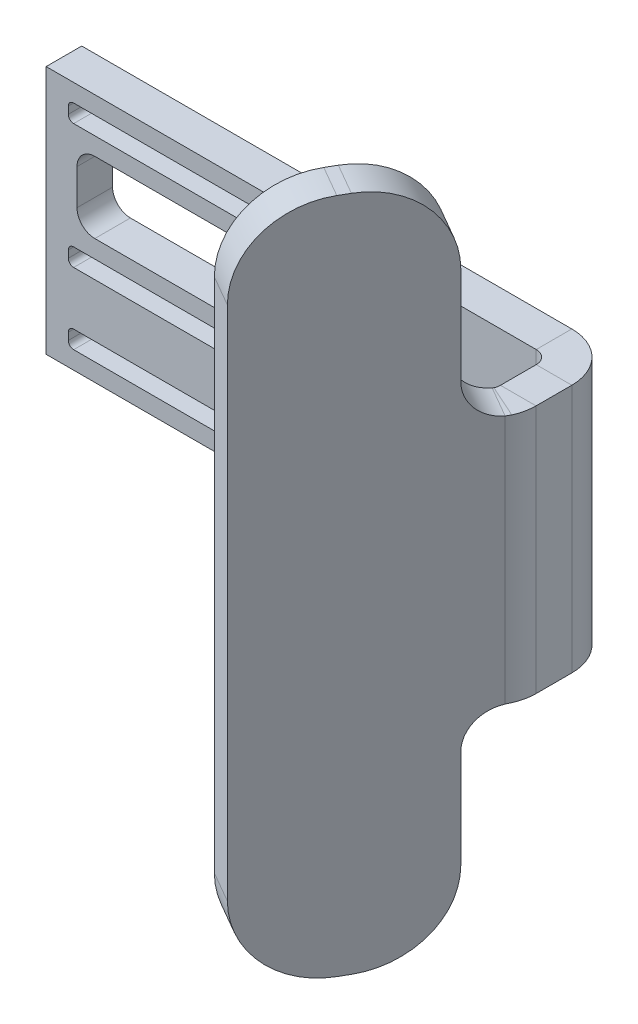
ISO-10303-21;
HEADER;
FILE_DESCRIPTION(('STEP AP214'),'2;1');
FILE_NAME('part.step','',(''),(''),'','','');
FILE_SCHEMA(('AUTOMOTIVE_DESIGN { 1 0 10303 214 1 1 1 1 }'));
ENDSEC;
DATA;
#1=APPLICATION_CONTEXT('core data for automotive mechanical design processes');
#2=APPLICATION_PROTOCOL_DEFINITION('international standard','automotive_design',2000,#1);
#3=PRODUCT_CONTEXT('',#1,'mechanical');
#4=PRODUCT('Part','Part','',(#3));
#5=PRODUCT_RELATED_PRODUCT_CATEGORY('part','',(#4));
#6=PRODUCT_DEFINITION_FORMATION('','',#4);
#7=PRODUCT_DEFINITION_CONTEXT('part definition',#1,'design');
#8=PRODUCT_DEFINITION('design','',#6,#7);
#9=PRODUCT_DEFINITION_SHAPE('','',#8);
#10=(LENGTH_UNIT() NAMED_UNIT(*) SI_UNIT(.MILLI.,.METRE.));
#11=(NAMED_UNIT(*) PLANE_ANGLE_UNIT() SI_UNIT($,.RADIAN.));
#12=(NAMED_UNIT(*) SI_UNIT($,.STERADIAN.) SOLID_ANGLE_UNIT());
#13=UNCERTAINTY_MEASURE_WITH_UNIT(LENGTH_MEASURE(1.E-05),#10,'distance_accuracy_value','');
#14=(GEOMETRIC_REPRESENTATION_CONTEXT(3) GLOBAL_UNCERTAINTY_ASSIGNED_CONTEXT((#13)) GLOBAL_UNIT_ASSIGNED_CONTEXT((#10,
#11,#12)) REPRESENTATION_CONTEXT('',''));
#15=CARTESIAN_POINT('',(0.,0.,0.));
#16=DIRECTION('',(0.,0.,1.));
#17=DIRECTION('',(1.,0.,0.));
#18=AXIS2_PLACEMENT_3D('',#15,#16,#17);
#19=CARTESIAN_POINT('',(28.266730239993,-9.,3.47862485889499));
#20=DIRECTION('',(1.,0.,0.));
#21=DIRECTION('',(0.,0.,-1.));
#22=AXIS2_PLACEMENT_3D('',#19,#20,#21);
#23=PLANE('',#22);
#24=DIRECTION('',(0.,0.,-1.));
#25=VECTOR('',#24,1.);
#26=CARTESIAN_POINT('',(28.2667302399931,7.,-29.521375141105));
#27=LINE('',#26,#25);
#28=CARTESIAN_POINT('',(28.266730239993,7.,2.74535509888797));
#29=VERTEX_POINT('',#28);
#30=CARTESIAN_POINT('',(28.266730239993,7.,0.736600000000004));
#31=VERTEX_POINT('',#30);
#32=EDGE_CURVE('E860',#29,#31,#27,.T.);
#33=ORIENTED_EDGE('',*,*,#32,.T.);
#34=DIRECTION('',(0.,-1.,0.));
#35=VECTOR('',#34,1.);
#36=CARTESIAN_POINT('',(28.266730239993,-9.,0.736600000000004));
#37=LINE('',#36,#35);
#38=CARTESIAN_POINT('',(28.266730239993,-7.,0.736600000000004));
#39=VERTEX_POINT('',#38);
#40=EDGE_CURVE('E70',#31,#39,#37,.T.);
#41=ORIENTED_EDGE('',*,*,#40,.T.);
#42=DIRECTION('',(0.,0.,1.));
#43=VECTOR('',#42,1.);
#44=CARTESIAN_POINT('',(28.2667302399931,-7.,-29.521375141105));
#45=LINE('',#44,#43);
#46=CARTESIAN_POINT('',(28.266730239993,-7.,2.74535509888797));
#47=VERTEX_POINT('',#46);
#48=EDGE_CURVE('E856',#39,#47,#45,.T.);
#49=ORIENTED_EDGE('',*,*,#48,.T.);
#50=DIRECTION('',(0.,-1.,0.));
#51=VECTOR('',#50,1.);
#52=CARTESIAN_POINT('',(28.266730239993,-9.,2.74535509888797));
#53=LINE('',#52,#51);
#54=EDGE_CURVE('E864',#29,#47,#53,.T.);
#55=ORIENTED_EDGE('',*,*,#54,.F.);
#56=EDGE_LOOP('',(#33,#41,#49,#55));
#57=FACE_BOUND('',#56,.T.);
#58=ADVANCED_FACE('F61',(#57),#23,.F.);
#59=CARTESIAN_POINT('',(28.2560504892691,-9.,2.96122434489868));
#60=DIRECTION('',(0.866025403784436,0.,0.500000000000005));
#61=DIRECTION('',(0.500000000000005,0.,-0.866025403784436));
#62=AXIS2_PLACEMENT_3D('',#59,#60,#61);
#63=PLANE('',#62);
#64=CARTESIAN_POINT('',(28.2560504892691,9.,2.96122434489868));
#65=DIRECTION('',(0.866025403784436,0.,0.500000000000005));
#66=DIRECTION('',(-0.500000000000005,0.,0.866025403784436));
#67=AXIS2_PLACEMENT_3D('',#64,#65,#66);
#68=CIRCLE('',#67,2.);
#69=CARTESIAN_POINT('',(27.2560504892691,9.,4.69327515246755));
#70=VERTEX_POINT('',#69);
#71=CARTESIAN_POINT('',(28.1680445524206,7.00776009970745,3.11365509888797));
#72=VERTEX_POINT('',#71);
#73=EDGE_CURVE('E924',#70,#72,#68,.T.);
#74=ORIENTED_EDGE('',*,*,#73,.T.);
#75=DIRECTION('',(0.,-1.,0.));
#76=VECTOR('',#75,1.);
#77=CARTESIAN_POINT('',(28.1680445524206,-9.,3.11365509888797));
#78=LINE('',#77,#76);
#79=CARTESIAN_POINT('',(28.1680445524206,-7.00776009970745,3.11365509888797));
#80=VERTEX_POINT('',#79);
#81=EDGE_CURVE('E967',#72,#80,#78,.T.);
#82=ORIENTED_EDGE('',*,*,#81,.T.);
#83=CARTESIAN_POINT('',(28.2560504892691,-9.,2.96122434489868));
#84=DIRECTION('',(0.866025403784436,0.,0.500000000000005));
#85=DIRECTION('',(0.500000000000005,0.,-0.866025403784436));
#86=AXIS2_PLACEMENT_3D('',#83,#84,#85);
#87=CIRCLE('',#86,2.);
#88=CARTESIAN_POINT('',(27.2560504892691,-9.00000000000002,4.69327515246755));
#89=VERTEX_POINT('',#88);
#90=EDGE_CURVE('E900',#80,#89,#87,.T.);
#91=ORIENTED_EDGE('',*,*,#90,.T.);
#92=DIRECTION('',(0.,-1.,0.));
#93=VECTOR('',#92,1.);
#94=CARTESIAN_POINT('',(27.2560504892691,-9.00000000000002,4.69327515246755));
#95=LINE('',#94,#93);
#96=CARTESIAN_POINT('',(27.2560504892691,-14.5,4.69327515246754));
#97=VERTEX_POINT('',#96);
#98=EDGE_CURVE('E896',#89,#97,#95,.T.);
#99=ORIENTED_EDGE('',*,*,#98,.T.);
#100=CARTESIAN_POINT('',(25.0060504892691,-14.5,8.59038946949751));
#101=DIRECTION('',(-0.866025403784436,0.,-0.500000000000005));
#102=DIRECTION('',(-0.500000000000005,0.,0.866025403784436));
#103=AXIS2_PLACEMENT_3D('',#100,#101,#102);
#104=CIRCLE('',#103,4.50000000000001);
#105=CARTESIAN_POINT('',(25.0060504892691,-19.,8.59038946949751));
#106=VERTEX_POINT('',#105);
#107=EDGE_CURVE('E899',#97,#106,#104,.T.);
#108=ORIENTED_EDGE('',*,*,#107,.T.);
#109=DIRECTION('',(-0.500000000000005,0.,0.866025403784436));
#110=VECTOR('',#109,1.);
#111=CARTESIAN_POINT('',(25.0060504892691,-19.,8.59038946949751));
#112=LINE('',#111,#110);
#113=CARTESIAN_POINT('',(24.7060504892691,-19.,9.11000471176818));
#114=VERTEX_POINT('',#113);
#115=EDGE_CURVE('E903',#106,#114,#112,.T.);
#116=ORIENTED_EDGE('',*,*,#115,.T.);
#117=CARTESIAN_POINT('',(24.7060504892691,-14.5,9.11000471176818));
#118=DIRECTION('',(-0.866025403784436,0.,-0.500000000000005));
#119=DIRECTION('',(-0.500000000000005,0.,0.866025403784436));
#120=AXIS2_PLACEMENT_3D('',#117,#118,#119);
#121=CIRCLE('',#120,4.49999999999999);
#122=CARTESIAN_POINT('',(22.456050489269,-14.5,13.0071190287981));
#123=VERTEX_POINT('',#122);
#124=EDGE_CURVE('E906',#114,#123,#121,.T.);
#125=ORIENTED_EDGE('',*,*,#124,.T.);
#126=DIRECTION('',(0.,1.,0.));
#127=VECTOR('',#126,1.);
#128=CARTESIAN_POINT('',(22.456050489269,14.5,13.0071190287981));
#129=LINE('',#128,#127);
#130=CARTESIAN_POINT('',(22.456050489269,14.5,13.0071190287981));
#131=VERTEX_POINT('',#130);
#132=EDGE_CURVE('E909',#123,#131,#129,.T.);
#133=ORIENTED_EDGE('',*,*,#132,.T.);
#134=CARTESIAN_POINT('',(24.7060504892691,14.5,9.11000471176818));
#135=DIRECTION('',(-0.866025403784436,0.,-0.500000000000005));
#136=DIRECTION('',(0.500000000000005,0.,-0.866025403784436));
#137=AXIS2_PLACEMENT_3D('',#134,#135,#136);
#138=CIRCLE('',#137,4.49999999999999);
#139=CARTESIAN_POINT('',(24.7060504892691,19.,9.11000471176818));
#140=VERTEX_POINT('',#139);
#141=EDGE_CURVE('E912',#131,#140,#138,.T.);
#142=ORIENTED_EDGE('',*,*,#141,.T.);
#143=DIRECTION('',(0.500000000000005,0.,-0.866025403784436));
#144=VECTOR('',#143,1.);
#145=CARTESIAN_POINT('',(25.0060504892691,19.,8.59038946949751));
#146=LINE('',#145,#144);
#147=CARTESIAN_POINT('',(25.0060504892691,19.,8.59038946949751));
#148=VERTEX_POINT('',#147);
#149=EDGE_CURVE('E915',#140,#148,#146,.T.);
#150=ORIENTED_EDGE('',*,*,#149,.T.);
#151=CARTESIAN_POINT('',(25.0060504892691,14.5,8.59038946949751));
#152=DIRECTION('',(-0.866025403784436,0.,-0.500000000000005));
#153=DIRECTION('',(-0.500000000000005,0.,0.866025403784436));
#154=AXIS2_PLACEMENT_3D('',#151,#152,#153);
#155=CIRCLE('',#154,4.50000000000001);
#156=CARTESIAN_POINT('',(27.2560504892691,14.5,4.69327515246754));
#157=VERTEX_POINT('',#156);
#158=EDGE_CURVE('E918',#148,#157,#155,.T.);
#159=ORIENTED_EDGE('',*,*,#158,.T.);
#160=DIRECTION('',(0.,-1.,0.));
#161=VECTOR('',#160,1.);
#162=CARTESIAN_POINT('',(27.2560504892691,14.5,4.69327515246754));
#163=LINE('',#162,#161);
#164=EDGE_CURVE('E921',#157,#70,#163,.T.);
#165=ORIENTED_EDGE('',*,*,#164,.T.);
#166=EDGE_LOOP('',(#74,#82,#91,#99,#108,#116,#125,#133,#142,#150,#159,#165));
#167=FACE_BOUND('',#166,.T.);
#168=ADVANCED_FACE('F980',(#167),#63,.F.);
#169=CARTESIAN_POINT('',(29.988101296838,9.,3.96122434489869));
#170=DIRECTION('',(-0.866025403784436,0.,-0.500000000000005));
#171=DIRECTION('',(-0.500000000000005,0.,0.866025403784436));
#172=AXIS2_PLACEMENT_3D('',#169,#170,#171);
#173=CYLINDRICAL_SURFACE('',#172,2.);
#174=CARTESIAN_POINT('',(28.1680445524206,7.00776009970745,3.11365509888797));
#175=CARTESIAN_POINT('',(29.9000953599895,7.00776009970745,4.11365509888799));
#176=B_SPLINE_CURVE_WITH_KNOTS('',1,(#174,#175),.UNSPECIFIED.,.F.,.F.,(2,2),(0.,1.),.UNSPECIFIED.);
#177=CARTESIAN_POINT('',(29.9000953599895,7.00776009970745,4.11365509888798));
#178=VERTEX_POINT('',#177);
#179=EDGE_CURVE('E962',#72,#178,#176,.T.);
#180=ORIENTED_EDGE('',*,*,#179,.F.);
#181=ORIENTED_EDGE('',*,*,#73,.F.);
#182=DIRECTION('',(-0.866025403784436,0.,-0.500000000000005));
#183=VECTOR('',#182,1.);
#184=CARTESIAN_POINT('',(28.988101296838,9.,5.69327515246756));
#185=LINE('',#184,#183);
#186=CARTESIAN_POINT('',(28.988101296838,9.,5.69327515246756));
#187=VERTEX_POINT('',#186);
#188=EDGE_CURVE('E925',#187,#70,#185,.T.);
#189=ORIENTED_EDGE('',*,*,#188,.F.);
#190=CARTESIAN_POINT('',(29.988101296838,9.,3.96122434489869));
#191=DIRECTION('',(0.866025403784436,0.,0.500000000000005));
#192=DIRECTION('',(-0.500000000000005,0.,0.866025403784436));
#193=AXIS2_PLACEMENT_3D('',#190,#191,#192);
#194=CIRCLE('',#193,2.);
#195=EDGE_CURVE('E895',#187,#178,#194,.T.);
#196=ORIENTED_EDGE('',*,*,#195,.T.);
#197=EDGE_LOOP('',(#180,#181,#189,#196));
#198=FACE_BOUND('',#197,.T.);
#199=ADVANCED_FACE('F969',(#198),#173,.F.);
#200=CARTESIAN_POINT('',(28.988101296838,14.5,5.69327515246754));
#201=DIRECTION('',(0.500000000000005,0.,-0.866025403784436));
#202=DIRECTION('',(0.,-1.,0.));
#203=AXIS2_PLACEMENT_3D('',#200,#201,#202);
#204=PLANE('',#203);
#205=ORIENTED_EDGE('',*,*,#164,.F.);
#206=DIRECTION('',(-0.866025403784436,0.,-0.500000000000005));
#207=VECTOR('',#206,1.);
#208=CARTESIAN_POINT('',(28.988101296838,14.5,5.69327515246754));
#209=LINE('',#208,#207);
#210=CARTESIAN_POINT('',(28.988101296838,14.5,5.69327515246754));
#211=VERTEX_POINT('',#210);
#212=EDGE_CURVE('E928',#211,#157,#209,.T.);
#213=ORIENTED_EDGE('',*,*,#212,.F.);
#214=DIRECTION('',(0.,-1.,0.));
#215=VECTOR('',#214,1.);
#216=CARTESIAN_POINT('',(28.988101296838,14.5,5.69327515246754));
#217=LINE('',#216,#215);
#218=EDGE_CURVE('E892',#211,#187,#217,.T.);
#219=ORIENTED_EDGE('',*,*,#218,.T.);
#220=ORIENTED_EDGE('',*,*,#188,.T.);
#221=EDGE_LOOP('',(#205,#213,#219,#220));
#222=FACE_BOUND('',#221,.T.);
#223=ADVANCED_FACE('F979',(#222),#204,.T.);
#224=CARTESIAN_POINT('',(26.7381012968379,14.5,9.59038946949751));
#225=DIRECTION('',(-0.866025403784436,0.,-0.500000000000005));
#226=DIRECTION('',(-0.500000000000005,0.,0.866025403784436));
#227=AXIS2_PLACEMENT_3D('',#224,#225,#226);
#228=CYLINDRICAL_SURFACE('',#227,4.50000000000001);
#229=ORIENTED_EDGE('',*,*,#158,.F.);
#230=DIRECTION('',(-0.866025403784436,0.,-0.500000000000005));
#231=VECTOR('',#230,1.);
#232=CARTESIAN_POINT('',(26.7381012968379,19.,9.59038946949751));
#233=LINE('',#232,#231);
#234=CARTESIAN_POINT('',(26.7381012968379,19.,9.59038946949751));
#235=VERTEX_POINT('',#234);
#236=EDGE_CURVE('E930',#235,#148,#233,.T.);
#237=ORIENTED_EDGE('',*,*,#236,.F.);
#238=CARTESIAN_POINT('',(26.7381012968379,14.5,9.59038946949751));
#239=DIRECTION('',(-0.866025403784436,0.,-0.500000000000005));
#240=DIRECTION('',(-0.500000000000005,0.,0.866025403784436));
#241=AXIS2_PLACEMENT_3D('',#238,#239,#240);
#242=CIRCLE('',#241,4.50000000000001);
#243=EDGE_CURVE('E889',#235,#211,#242,.T.);
#244=ORIENTED_EDGE('',*,*,#243,.T.);
#245=ORIENTED_EDGE('',*,*,#212,.T.);
#246=EDGE_LOOP('',(#229,#237,#244,#245));
#247=FACE_BOUND('',#246,.T.);
#248=ADVANCED_FACE('F1732',(#247),#228,.T.);
#249=CARTESIAN_POINT('',(26.7381012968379,19.,9.59038946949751));
#250=DIRECTION('',(0.,1.,0.));
#251=DIRECTION('',(0.500000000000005,0.,-0.866025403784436));
#252=AXIS2_PLACEMENT_3D('',#249,#250,#251);
#253=PLANE('',#252);
#254=ORIENTED_EDGE('',*,*,#149,.F.);
#255=DIRECTION('',(-0.866025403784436,0.,-0.500000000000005));
#256=VECTOR('',#255,1.);
#257=CARTESIAN_POINT('',(26.4381012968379,19.,10.1100047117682));
#258=LINE('',#257,#256);
#259=CARTESIAN_POINT('',(26.4381012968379,19.,10.1100047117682));
#260=VERTEX_POINT('',#259);
#261=EDGE_CURVE('E932',#260,#140,#258,.T.);
#262=ORIENTED_EDGE('',*,*,#261,.F.);
#263=DIRECTION('',(0.500000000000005,0.,-0.866025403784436));
#264=VECTOR('',#263,1.);
#265=CARTESIAN_POINT('',(26.7381012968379,19.,9.59038946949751));
#266=LINE('',#265,#264);
#267=EDGE_CURVE('E886',#260,#235,#266,.T.);
#268=ORIENTED_EDGE('',*,*,#267,.T.);
#269=ORIENTED_EDGE('',*,*,#236,.T.);
#270=EDGE_LOOP('',(#254,#262,#268,#269));
#271=FACE_BOUND('',#270,.T.);
#272=ADVANCED_FACE('F1728',(#271),#253,.T.);
#273=CARTESIAN_POINT('',(26.4381012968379,14.5,10.1100047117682));
#274=DIRECTION('',(-0.866025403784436,0.,-0.500000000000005));
#275=DIRECTION('',(-0.500000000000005,0.,0.866025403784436));
#276=AXIS2_PLACEMENT_3D('',#273,#274,#275);
#277=CYLINDRICAL_SURFACE('',#276,4.49999999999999);
#278=ORIENTED_EDGE('',*,*,#141,.F.);
#279=DIRECTION('',(-0.866025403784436,0.,-0.500000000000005));
#280=VECTOR('',#279,1.);
#281=CARTESIAN_POINT('',(24.1881012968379,14.5,14.0071190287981));
#282=LINE('',#281,#280);
#283=CARTESIAN_POINT('',(24.1881012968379,14.5,14.0071190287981));
#284=VERTEX_POINT('',#283);
#285=EDGE_CURVE('E934',#284,#131,#282,.T.);
#286=ORIENTED_EDGE('',*,*,#285,.F.);
#287=CARTESIAN_POINT('',(26.4381012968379,14.5,10.1100047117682));
#288=DIRECTION('',(-0.866025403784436,0.,-0.500000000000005));
#289=DIRECTION('',(0.500000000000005,0.,-0.866025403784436));
#290=AXIS2_PLACEMENT_3D('',#287,#288,#289);
#291=CIRCLE('',#290,4.49999999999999);
#292=EDGE_CURVE('E883',#284,#260,#291,.T.);
#293=ORIENTED_EDGE('',*,*,#292,.T.);
#294=ORIENTED_EDGE('',*,*,#261,.T.);
#295=EDGE_LOOP('',(#278,#286,#293,#294));
#296=FACE_BOUND('',#295,.T.);
#297=ADVANCED_FACE('F1724',(#296),#277,.T.);
#298=CARTESIAN_POINT('',(24.1881012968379,14.5,14.0071190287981));
#299=DIRECTION('',(-0.500000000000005,0.,0.866025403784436));
#300=DIRECTION('',(0.866025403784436,0.,0.500000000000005));
#301=AXIS2_PLACEMENT_3D('',#298,#299,#300);
#302=PLANE('',#301);
#303=ORIENTED_EDGE('',*,*,#132,.F.);
#304=DIRECTION('',(-0.866025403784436,0.,-0.500000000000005));
#305=VECTOR('',#304,1.);
#306=CARTESIAN_POINT('',(24.1881012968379,-14.5,14.0071190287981));
#307=LINE('',#306,#305);
#308=CARTESIAN_POINT('',(24.1881012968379,-14.5,14.0071190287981));
#309=VERTEX_POINT('',#308);
#310=EDGE_CURVE('E936',#309,#123,#307,.T.);
#311=ORIENTED_EDGE('',*,*,#310,.F.);
#312=DIRECTION('',(0.,1.,0.));
#313=VECTOR('',#312,1.);
#314=CARTESIAN_POINT('',(24.1881012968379,14.5,14.0071190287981));
#315=LINE('',#314,#313);
#316=EDGE_CURVE('E880',#309,#284,#315,.T.);
#317=ORIENTED_EDGE('',*,*,#316,.T.);
#318=ORIENTED_EDGE('',*,*,#285,.T.);
#319=EDGE_LOOP('',(#303,#311,#317,#318));
#320=FACE_BOUND('',#319,.T.);
#321=ADVANCED_FACE('F1720',(#320),#302,.T.);
#322=CARTESIAN_POINT('',(26.4381012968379,-14.5,10.1100047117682));
#323=DIRECTION('',(-0.866025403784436,0.,-0.500000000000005));
#324=DIRECTION('',(-0.500000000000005,0.,0.866025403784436));
#325=AXIS2_PLACEMENT_3D('',#322,#323,#324);
#326=CYLINDRICAL_SURFACE('',#325,4.49999999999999);
#327=ORIENTED_EDGE('',*,*,#124,.F.);
#328=DIRECTION('',(-0.866025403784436,0.,-0.500000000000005));
#329=VECTOR('',#328,1.);
#330=CARTESIAN_POINT('',(26.4381012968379,-19.,10.1100047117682));
#331=LINE('',#330,#329);
#332=CARTESIAN_POINT('',(26.4381012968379,-19.,10.1100047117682));
#333=VERTEX_POINT('',#332);
#334=EDGE_CURVE('E938',#333,#114,#331,.T.);
#335=ORIENTED_EDGE('',*,*,#334,.F.);
#336=CARTESIAN_POINT('',(26.4381012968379,-14.5,10.1100047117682));
#337=DIRECTION('',(-0.866025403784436,0.,-0.500000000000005));
#338=DIRECTION('',(-0.500000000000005,0.,0.866025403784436));
#339=AXIS2_PLACEMENT_3D('',#336,#337,#338);
#340=CIRCLE('',#339,4.49999999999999);
#341=EDGE_CURVE('E877',#333,#309,#340,.T.);
#342=ORIENTED_EDGE('',*,*,#341,.T.);
#343=ORIENTED_EDGE('',*,*,#310,.T.);
#344=EDGE_LOOP('',(#327,#335,#342,#343));
#345=FACE_BOUND('',#344,.T.);
#346=ADVANCED_FACE('F1716',(#345),#326,.T.);
#347=CARTESIAN_POINT('',(26.7381012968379,-19.,9.59038946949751));
#348=DIRECTION('',(0.,-1.,0.));
#349=DIRECTION('',(-0.500000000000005,0.,0.866025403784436));
#350=AXIS2_PLACEMENT_3D('',#347,#348,#349);
#351=PLANE('',#350);
#352=ORIENTED_EDGE('',*,*,#115,.F.);
#353=DIRECTION('',(-0.866025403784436,0.,-0.500000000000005));
#354=VECTOR('',#353,1.);
#355=CARTESIAN_POINT('',(26.7381012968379,-19.,9.59038946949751));
#356=LINE('',#355,#354);
#357=CARTESIAN_POINT('',(26.7381012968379,-19.,9.59038946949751));
#358=VERTEX_POINT('',#357);
#359=EDGE_CURVE('E940',#358,#106,#356,.T.);
#360=ORIENTED_EDGE('',*,*,#359,.F.);
#361=DIRECTION('',(-0.500000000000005,0.,0.866025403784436));
#362=VECTOR('',#361,1.);
#363=CARTESIAN_POINT('',(26.7381012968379,-19.,9.59038946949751));
#364=LINE('',#363,#362);
#365=EDGE_CURVE('E874',#358,#333,#364,.T.);
#366=ORIENTED_EDGE('',*,*,#365,.T.);
#367=ORIENTED_EDGE('',*,*,#334,.T.);
#368=EDGE_LOOP('',(#352,#360,#366,#367));
#369=FACE_BOUND('',#368,.T.);
#370=ADVANCED_FACE('F1712',(#369),#351,.T.);
#371=CARTESIAN_POINT('',(26.7381012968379,-14.5,9.59038946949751));
#372=DIRECTION('',(-0.866025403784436,0.,-0.500000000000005));
#373=DIRECTION('',(-0.500000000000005,0.,0.866025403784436));
#374=AXIS2_PLACEMENT_3D('',#371,#372,#373);
#375=CYLINDRICAL_SURFACE('',#374,4.50000000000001);
#376=ORIENTED_EDGE('',*,*,#107,.F.);
#377=DIRECTION('',(-0.866025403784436,0.,-0.500000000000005));
#378=VECTOR('',#377,1.);
#379=CARTESIAN_POINT('',(28.988101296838,-14.5,5.69327515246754));
#380=LINE('',#379,#378);
#381=CARTESIAN_POINT('',(28.988101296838,-14.5,5.69327515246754));
#382=VERTEX_POINT('',#381);
#383=EDGE_CURVE('E942',#382,#97,#380,.T.);
#384=ORIENTED_EDGE('',*,*,#383,.F.);
#385=CARTESIAN_POINT('',(26.7381012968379,-14.5,9.59038946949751));
#386=DIRECTION('',(-0.866025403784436,0.,-0.500000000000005));
#387=DIRECTION('',(-0.500000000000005,0.,0.866025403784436));
#388=AXIS2_PLACEMENT_3D('',#385,#386,#387);
#389=CIRCLE('',#388,4.50000000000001);
#390=EDGE_CURVE('E870',#382,#358,#389,.T.);
#391=ORIENTED_EDGE('',*,*,#390,.T.);
#392=ORIENTED_EDGE('',*,*,#359,.T.);
#393=EDGE_LOOP('',(#376,#384,#391,#392));
#394=FACE_BOUND('',#393,.T.);
#395=ADVANCED_FACE('F1708',(#394),#375,.T.);
#396=CARTESIAN_POINT('',(28.988101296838,-9.00000000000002,5.69327515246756));
#397=DIRECTION('',(0.500000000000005,0.,-0.866025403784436));
#398=DIRECTION('',(0.,-1.,0.));
#399=AXIS2_PLACEMENT_3D('',#396,#397,#398);
#400=PLANE('',#399);
#401=ORIENTED_EDGE('',*,*,#98,.F.);
#402=DIRECTION('',(-0.866025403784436,0.,-0.500000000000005));
#403=VECTOR('',#402,1.);
#404=CARTESIAN_POINT('',(28.988101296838,-9.00000000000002,5.69327515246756));
#405=LINE('',#404,#403);
#406=CARTESIAN_POINT('',(28.988101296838,-9.00000000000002,5.69327515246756));
#407=VERTEX_POINT('',#406);
#408=EDGE_CURVE('E944',#407,#89,#405,.T.);
#409=ORIENTED_EDGE('',*,*,#408,.F.);
#410=DIRECTION('',(0.,-1.,0.));
#411=VECTOR('',#410,1.);
#412=CARTESIAN_POINT('',(28.988101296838,-9.00000000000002,5.69327515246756));
#413=LINE('',#412,#411);
#414=EDGE_CURVE('E867',#407,#382,#413,.T.);
#415=ORIENTED_EDGE('',*,*,#414,.T.);
#416=ORIENTED_EDGE('',*,*,#383,.T.);
#417=EDGE_LOOP('',(#401,#409,#415,#416));
#418=FACE_BOUND('',#417,.T.);
#419=ADVANCED_FACE('F1703',(#418),#400,.T.);
#420=CARTESIAN_POINT('',(29.988101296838,-9.,3.96122434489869));
#421=DIRECTION('',(-0.866025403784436,0.,-0.500000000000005));
#422=DIRECTION('',(-0.500000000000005,0.,0.866025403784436));
#423=AXIS2_PLACEMENT_3D('',#420,#421,#422);
#424=CYLINDRICAL_SURFACE('',#423,2.);
#425=CARTESIAN_POINT('',(29.9000953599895,-7.00776009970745,4.11365509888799));
#426=CARTESIAN_POINT('',(28.1680445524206,-7.00776009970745,3.11365509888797));
#427=B_SPLINE_CURVE_WITH_KNOTS('',1,(#425,#426),.UNSPECIFIED.,.F.,.F.,(2,2),(0.,1.),.UNSPECIFIED.);
#428=CARTESIAN_POINT('',(29.9000953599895,-7.00776009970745,4.11365509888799));
#429=VERTEX_POINT('',#428);
#430=EDGE_CURVE('E951',#429,#80,#427,.T.);
#431=ORIENTED_EDGE('',*,*,#430,.F.);
#432=CARTESIAN_POINT('',(29.988101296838,-9.,3.96122434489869));
#433=DIRECTION('',(0.866025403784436,0.,0.500000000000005));
#434=DIRECTION('',(0.500000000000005,0.,-0.866025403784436));
#435=AXIS2_PLACEMENT_3D('',#432,#433,#434);
#436=CIRCLE('',#435,2.);
#437=EDGE_CURVE('E871',#429,#407,#436,.T.);
#438=ORIENTED_EDGE('',*,*,#437,.T.);
#439=ORIENTED_EDGE('',*,*,#408,.T.);
#440=ORIENTED_EDGE('',*,*,#90,.F.);
#441=EDGE_LOOP('',(#431,#438,#439,#440));
#442=FACE_BOUND('',#441,.T.);
#443=ADVANCED_FACE('F1694',(#442),#424,.F.);
#444=CARTESIAN_POINT('',(29.988101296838,-9.,3.96122434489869));
#445=DIRECTION('',(0.866025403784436,0.,0.500000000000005));
#446=DIRECTION('',(0.500000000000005,0.,-0.866025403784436));
#447=AXIS2_PLACEMENT_3D('',#444,#445,#446);
#448=PLANE('',#447);
#449=DIRECTION('',(0.,-1.,0.));
#450=VECTOR('',#449,1.);
#451=CARTESIAN_POINT('',(29.9000953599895,-9.,4.11365509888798));
#452=LINE('',#451,#450);
#453=EDGE_CURVE('E927',#178,#429,#452,.T.);
#454=ORIENTED_EDGE('',*,*,#453,.F.);
#455=ORIENTED_EDGE('',*,*,#195,.F.);
#456=ORIENTED_EDGE('',*,*,#218,.F.);
#457=ORIENTED_EDGE('',*,*,#243,.F.);
#458=ORIENTED_EDGE('',*,*,#267,.F.);
#459=ORIENTED_EDGE('',*,*,#292,.F.);
#460=ORIENTED_EDGE('',*,*,#316,.F.);
#461=ORIENTED_EDGE('',*,*,#341,.F.);
#462=ORIENTED_EDGE('',*,*,#365,.F.);
#463=ORIENTED_EDGE('',*,*,#390,.F.);
#464=ORIENTED_EDGE('',*,*,#414,.F.);
#465=ORIENTED_EDGE('',*,*,#437,.F.);
#466=EDGE_LOOP('',(#454,#455,#456,#457,#458,#459,#460,#461,#462,#463,#464,#465));
#467=FACE_BOUND('',#466,.T.);
#468=ADVANCED_FACE('F986',(#467),#448,.T.);
#469=CARTESIAN_POINT('',(30.266730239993,-9.,3.478624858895));
#470=DIRECTION('',(1.,0.,0.));
#471=DIRECTION('',(0.,0.,-1.));
#472=AXIS2_PLACEMENT_3D('',#469,#470,#471);
#473=PLANE('',#472);
#474=DIRECTION('',(0.,-1.,0.));
#475=VECTOR('',#474,1.);
#476=CARTESIAN_POINT('',(30.266730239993,-9.,0.736600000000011));
#477=LINE('',#476,#475);
#478=CARTESIAN_POINT('',(30.266730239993,7.,0.736600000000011));
#479=VERTEX_POINT('',#478);
#480=CARTESIAN_POINT('',(30.266730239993,-7.,0.736600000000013));
#481=VERTEX_POINT('',#480);
#482=EDGE_CURVE('E1027',#479,#481,#477,.T.);
#483=ORIENTED_EDGE('',*,*,#482,.F.);
#484=DIRECTION('',(0.,0.,-1.));
#485=VECTOR('',#484,1.);
#486=CARTESIAN_POINT('',(30.2667302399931,7.,-29.521375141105));
#487=LINE('',#486,#485);
#488=CARTESIAN_POINT('',(30.266730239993,7.,2.74535509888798));
#489=VERTEX_POINT('',#488);
#490=EDGE_CURVE('E855',#489,#479,#487,.T.);
#491=ORIENTED_EDGE('',*,*,#490,.F.);
#492=DIRECTION('',(0.,-1.,0.));
#493=VECTOR('',#492,1.);
#494=CARTESIAN_POINT('',(30.266730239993,-9.,2.74535509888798));
#495=LINE('',#494,#493);
#496=CARTESIAN_POINT('',(30.266730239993,-7.,2.74535509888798));
#497=VERTEX_POINT('',#496);
#498=EDGE_CURVE('E861',#489,#497,#495,.T.);
#499=ORIENTED_EDGE('',*,*,#498,.T.);
#500=DIRECTION('',(0.,0.,1.));
#501=VECTOR('',#500,1.);
#502=CARTESIAN_POINT('',(30.2667302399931,-7.,-29.521375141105));
#503=LINE('',#502,#501);
#504=EDGE_CURVE('E65',#481,#497,#503,.T.);
#505=ORIENTED_EDGE('',*,*,#504,.F.);
#506=EDGE_LOOP('',(#483,#491,#499,#505));
#507=FACE_BOUND('',#506,.T.);
#508=ADVANCED_FACE('F982',(#507),#473,.T.);
#509=CARTESIAN_POINT('',(30.2667302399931,-7.,-29.521375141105));
#510=DIRECTION('',(0.,-1.,0.));
#511=DIRECTION('',(1.,0.,0.));
#512=AXIS2_PLACEMENT_3D('',#509,#510,#511);
#513=PLANE('',#512);
#514=DIRECTION('',(-1.,0.,0.));
#515=VECTOR('',#514,1.);
#516=CARTESIAN_POINT('',(30.266730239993,-7.,0.736600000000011));
#517=LINE('',#516,#515);
#518=EDGE_CURVE('E1011',#481,#39,#517,.T.);
#519=ORIENTED_EDGE('',*,*,#518,.F.);
#520=ORIENTED_EDGE('',*,*,#504,.T.);
#521=DIRECTION('',(-1.,0.,0.));
#522=VECTOR('',#521,1.);
#523=CARTESIAN_POINT('',(30.266730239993,-7.,2.74535509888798));
#524=LINE('',#523,#522);
#525=EDGE_CURVE('E857',#497,#47,#524,.T.);
#526=ORIENTED_EDGE('',*,*,#525,.T.);
#527=ORIENTED_EDGE('',*,*,#48,.F.);
#528=EDGE_LOOP('',(#519,#520,#526,#527));
#529=FACE_BOUND('',#528,.T.);
#530=ADVANCED_FACE('F985',(#529),#513,.T.);
#531=CARTESIAN_POINT('',(30.2667302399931,7.,-29.521375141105));
#532=DIRECTION('',(0.,1.,0.));
#533=DIRECTION('',(0.,0.,-1.));
#534=AXIS2_PLACEMENT_3D('',#531,#532,#533);
#535=PLANE('',#534);
#536=DIRECTION('',(1.,0.,0.));
#537=VECTOR('',#536,1.);
#538=CARTESIAN_POINT('',(30.266730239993,7.,0.736600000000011));
#539=LINE('',#538,#537);
#540=EDGE_CURVE('E12',#31,#479,#539,.T.);
#541=ORIENTED_EDGE('',*,*,#540,.F.);
#542=ORIENTED_EDGE('',*,*,#32,.F.);
#543=DIRECTION('',(1.,0.,0.));
#544=VECTOR('',#543,1.);
#545=CARTESIAN_POINT('',(30.266730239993,7.,2.74535509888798));
#546=LINE('',#545,#544);
#547=EDGE_CURVE('E847',#29,#489,#546,.T.);
#548=ORIENTED_EDGE('',*,*,#547,.T.);
#549=ORIENTED_EDGE('',*,*,#490,.T.);
#550=EDGE_LOOP('',(#541,#542,#548,#549));
#551=FACE_BOUND('',#550,.T.);
#552=ADVANCED_FACE('F63',(#551),#535,.T.);
#553=CARTESIAN_POINT('',(30.0263785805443,7.,3.86683794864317));
#554=CARTESIAN_POINT('',(29.9884894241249,7.0025867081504,3.95117338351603));
#555=CARTESIAN_POINT('',(29.9463232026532,7.00517339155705,4.03358612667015));
#556=CARTESIAN_POINT('',(29.9000953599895,7.00776009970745,4.11365509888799));
#557=CARTESIAN_POINT('',(28.2020357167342,7.,3.04722028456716));
#558=CARTESIAN_POINT('',(28.1918372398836,7.00258670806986,3.0699205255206));
#559=CARTESIAN_POINT('',(28.1804875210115,7.00517339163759,3.09210324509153));
#560=CARTESIAN_POINT('',(28.1680445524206,7.00776009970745,3.11365509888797));
#561=B_SPLINE_SURFACE_WITH_KNOTS('',1,3,((#553,#554,#555,#556),(#557,#558,#559,#560)),
.UNSPECIFIED.,.F.,.F.,.F.,(2,2),(4,4),(0.,1.),(0.,1.),.UNSPECIFIED.);
#562=CARTESIAN_POINT('',(30.0263785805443,7.,3.86683794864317));
#563=CARTESIAN_POINT('',(28.2020357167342,7.,3.04722028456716));
#564=B_SPLINE_CURVE_WITH_KNOTS('',1,(#562,#563),.UNSPECIFIED.,.F.,.F.,(2,2),(0.,1.),.UNSPECIFIED.);
#565=CARTESIAN_POINT('',(28.2020357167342,7.,3.04722028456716));
#566=VERTEX_POINT('',#565);
#567=CARTESIAN_POINT('',(30.0263785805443,7.,3.86683794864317));
#568=VERTEX_POINT('',#567);
#569=EDGE_CURVE('E835',#566,#568,#564,.F.);
#570=CARTESIAN_POINT('',(28.2020357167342,7.,3.04722028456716));
#571=CARTESIAN_POINT('',(28.1918372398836,7.00258670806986,3.0699205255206));
#572=CARTESIAN_POINT('',(28.1804875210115,7.00517339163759,3.09210324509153));
#573=CARTESIAN_POINT('',(28.1680445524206,7.00776009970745,3.11365509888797));
#574=B_SPLINE_CURVE_WITH_KNOTS('',3,(#570,#571,#572,#573),.UNSPECIFIED.,.F.,.F.,(4,4),(0.,1.),.UNSPECIFIED.);
#575=EDGE_CURVE('E680',#566,#72,#574,.T.);
#576=CARTESIAN_POINT('',(29.9000953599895,7.00776009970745,4.11365509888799));
#577=CARTESIAN_POINT('',(29.9463232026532,7.00517339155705,4.03358612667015));
#578=CARTESIAN_POINT('',(29.9884894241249,7.0025867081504,3.95117338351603));
#579=CARTESIAN_POINT('',(30.0263785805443,7.,3.86683794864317));
#580=B_SPLINE_CURVE_WITH_KNOTS('',3,(#576,#577,#578,#579),.UNSPECIFIED.,.F.,.F.,(4,4),(0.,1.),.UNSPECIFIED.);
#581=EDGE_CURVE('E760',#568,#178,#580,.F.);
#582=ORIENTED_EDGE('',*,*,#569,.F.);
#583=ORIENTED_EDGE('',*,*,#575,.T.);
#584=ORIENTED_EDGE('',*,*,#179,.T.);
#585=ORIENTED_EDGE('',*,*,#581,.F.);
#586=EDGE_LOOP('',(#582,#583,#584,#585));
#587=FACE_BOUND('',#586,.T.);
#588=ADVANCED_FACE('F792',(#587),#561,.T.);
#589=CARTESIAN_POINT('',(29.9000953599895,-7.00776009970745,4.11365509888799));
#590=CARTESIAN_POINT('',(29.9463232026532,-7.00517339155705,4.03358612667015));
#591=CARTESIAN_POINT('',(29.9884894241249,-7.0025867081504,3.95117338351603));
#592=CARTESIAN_POINT('',(30.0263785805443,-7.,3.86683794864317));
#593=CARTESIAN_POINT('',(28.1680445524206,-7.00776009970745,3.11365509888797));
#594=CARTESIAN_POINT('',(28.1804875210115,-7.00517339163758,3.09210324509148));
#595=CARTESIAN_POINT('',(28.1918372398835,-7.00258670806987,3.06992052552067));
#596=CARTESIAN_POINT('',(28.2020357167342,-7.,3.04722028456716));
#597=B_SPLINE_SURFACE_WITH_KNOTS('',1,3,((#589,#590,#591,#592),(#593,#594,#595,#596)),
.UNSPECIFIED.,.F.,.F.,.F.,(2,2),(4,4),(0.,1.),(0.,1.),.UNSPECIFIED.);
#598=CARTESIAN_POINT('',(28.1680445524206,-7.00776009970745,3.11365509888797));
#599=CARTESIAN_POINT('',(28.1804875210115,-7.00517339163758,3.09210324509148));
#600=CARTESIAN_POINT('',(28.1918372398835,-7.00258670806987,3.06992052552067));
#601=CARTESIAN_POINT('',(28.2020357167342,-7.,3.04722028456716));
#602=B_SPLINE_CURVE_WITH_KNOTS('',3,(#598,#599,#600,#601),.UNSPECIFIED.,.F.,.F.,(4,4),(0.,1.),.UNSPECIFIED.);
#603=CARTESIAN_POINT('',(28.2020357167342,-7.,3.04722028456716));
#604=VERTEX_POINT('',#603);
#605=EDGE_CURVE('E713',#80,#604,#602,.T.);
#606=CARTESIAN_POINT('',(28.2020357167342,-7.,3.04722028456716));
#607=CARTESIAN_POINT('',(30.0263785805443,-7.,3.86683794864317));
#608=B_SPLINE_CURVE_WITH_KNOTS('',1,(#606,#607),.UNSPECIFIED.,.F.,.F.,(2,2),(0.,1.),.UNSPECIFIED.);
#609=CARTESIAN_POINT('',(30.0263785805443,-7.,3.86683794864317));
#610=VERTEX_POINT('',#609);
#611=EDGE_CURVE('E763',#604,#610,#608,.T.);
#612=CARTESIAN_POINT('',(30.0263785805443,-7.,3.86683794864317));
#613=CARTESIAN_POINT('',(29.9884894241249,-7.0025867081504,3.95117338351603));
#614=CARTESIAN_POINT('',(29.9463232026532,-7.00517339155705,4.03358612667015));
#615=CARTESIAN_POINT('',(29.9000953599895,-7.00776009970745,4.11365509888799));
#616=B_SPLINE_CURVE_WITH_KNOTS('',3,(#612,#613,#614,#615),.UNSPECIFIED.,.F.,.F.,(4,4),(0.,1.),.UNSPECIFIED.);
#617=EDGE_CURVE('E1654',#429,#610,#616,.F.);
#618=ORIENTED_EDGE('',*,*,#430,.T.);
#619=ORIENTED_EDGE('',*,*,#605,.T.);
#620=ORIENTED_EDGE('',*,*,#611,.T.);
#621=ORIENTED_EDGE('',*,*,#617,.F.);
#622=EDGE_LOOP('',(#618,#619,#620,#621));
#623=FACE_BOUND('',#622,.T.);
#624=ADVANCED_FACE('F803',(#623),#597,.T.);
#625=CARTESIAN_POINT('',(27.530130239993,-7.,2.74535509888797));
#626=DIRECTION('',(0.,-1.,0.));
#627=DIRECTION('',(1.,0.,0.));
#628=AXIS2_PLACEMENT_3D('',#625,#626,#627);
#629=PLANE('',#628);
#630=ORIENTED_EDGE('',*,*,#611,.F.);
#631=CARTESIAN_POINT('',(27.530130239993,-7.,2.74535509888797));
#632=DIRECTION('',(0.,-1.,0.));
#633=DIRECTION('',(1.,0.,0.));
#634=AXIS2_PLACEMENT_3D('',#631,#632,#633);
#635=CIRCLE('',#634,0.7366);
#636=EDGE_CURVE('E709',#604,#47,#635,.F.);
#637=ORIENTED_EDGE('',*,*,#636,.T.);
#638=ORIENTED_EDGE('',*,*,#525,.F.);
#639=CARTESIAN_POINT('',(27.530130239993,-7.,2.74535509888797));
#640=DIRECTION('',(0.,1.,0.));
#641=DIRECTION('',(1.,0.,0.));
#642=AXIS2_PLACEMENT_3D('',#639,#640,#641);
#643=CIRCLE('',#642,2.7366);
#644=EDGE_CURVE('E720',#610,#497,#643,.T.);
#645=ORIENTED_EDGE('',*,*,#644,.F.);
#646=EDGE_LOOP('',(#630,#637,#638,#645));
#647=FACE_BOUND('',#646,.T.);
#648=ADVANCED_FACE('F1037',(#647),#629,.T.);
#649=CARTESIAN_POINT('',(27.530130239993,7.,2.74535509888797));
#650=DIRECTION('',(0.,1.,0.));
#651=DIRECTION('',(-1.,0.,0.));
#652=AXIS2_PLACEMENT_3D('',#649,#650,#651);
#653=PLANE('',#652);
#654=CARTESIAN_POINT('',(27.530130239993,7.,2.74535509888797));
#655=DIRECTION('',(0.,-1.,0.));
#656=DIRECTION('',(1.,0.,0.));
#657=AXIS2_PLACEMENT_3D('',#654,#655,#656);
#658=CIRCLE('',#657,0.7366);
#659=EDGE_CURVE('E712',#29,#566,#658,.T.);
#660=ORIENTED_EDGE('',*,*,#659,.T.);
#661=ORIENTED_EDGE('',*,*,#569,.T.);
#662=CARTESIAN_POINT('',(27.530130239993,7.,2.74535509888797));
#663=DIRECTION('',(0.,-1.,0.));
#664=DIRECTION('',(-1.,0.,0.));
#665=AXIS2_PLACEMENT_3D('',#662,#663,#664);
#666=CIRCLE('',#665,2.7366);
#667=EDGE_CURVE('E761',#489,#568,#666,.T.);
#668=ORIENTED_EDGE('',*,*,#667,.F.);
#669=ORIENTED_EDGE('',*,*,#547,.F.);
#670=EDGE_LOOP('',(#660,#661,#668,#669));
#671=FACE_BOUND('',#670,.T.);
#672=ADVANCED_FACE('F734',(#671),#653,.T.);
#673=CARTESIAN_POINT('',(27.530130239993,14.1866697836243,2.74535509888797));
#674=DIRECTION('',(0.,-1.,0.));
#675=DIRECTION('',(1.,0.,0.));
#676=AXIS2_PLACEMENT_3D('',#673,#674,#675);
#677=CYLINDRICAL_SURFACE('',#676,2.7366);
#678=ORIENTED_EDGE('',*,*,#498,.F.);
#679=ORIENTED_EDGE('',*,*,#667,.T.);
#680=ORIENTED_EDGE('',*,*,#581,.T.);
#681=ORIENTED_EDGE('',*,*,#453,.T.);
#682=ORIENTED_EDGE('',*,*,#617,.T.);
#683=ORIENTED_EDGE('',*,*,#644,.T.);
#684=EDGE_LOOP('',(#678,#679,#680,#681,#682,#683));
#685=FACE_BOUND('',#684,.T.);
#686=ADVANCED_FACE('F723',(#685),#677,.T.);
#687=CARTESIAN_POINT('',(27.530130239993,14.1866697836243,2.74535509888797));
#688=DIRECTION('',(0.,-1.,0.));
#689=DIRECTION('',(1.,0.,0.));
#690=AXIS2_PLACEMENT_3D('',#687,#688,#689);
#691=CYLINDRICAL_SURFACE('',#690,0.7366);
#692=ORIENTED_EDGE('',*,*,#54,.T.);
#693=ORIENTED_EDGE('',*,*,#636,.F.);
#694=ORIENTED_EDGE('',*,*,#605,.F.);
#695=ORIENTED_EDGE('',*,*,#81,.F.);
#696=ORIENTED_EDGE('',*,*,#575,.F.);
#697=ORIENTED_EDGE('',*,*,#659,.F.);
#698=EDGE_LOOP('',(#692,#693,#694,#695,#696,#697));
#699=FACE_BOUND('',#698,.T.);
#700=ADVANCED_FACE('F733',(#699),#691,.F.);
#701=CARTESIAN_POINT('',(0.,7.,-2.));
#702=DIRECTION('',(-1.,0.,0.));
#703=DIRECTION('',(0.,0.,1.));
#704=AXIS2_PLACEMENT_3D('',#701,#702,#703);
#705=PLANE('',#704);
#706=DIRECTION('',(0.,-1.,0.));
#707=VECTOR('',#706,1.);
#708=CARTESIAN_POINT('',(0.,7.,0.));
#709=LINE('',#708,#707);
#710=CARTESIAN_POINT('',(0.,7.,0.));
#711=VERTEX_POINT('',#710);
#712=CARTESIAN_POINT('',(0.,-7.,0.));
#713=VERTEX_POINT('',#712);
#714=EDGE_CURVE('E689',#711,#713,#709,.T.);
#715=ORIENTED_EDGE('',*,*,#714,.F.);
#716=DIRECTION('',(0.,0.,1.));
#717=VECTOR('',#716,1.);
#718=CARTESIAN_POINT('',(0.,7.,-2.));
#719=LINE('',#718,#717);
#720=CARTESIAN_POINT('',(0.,7.,-2.));
#721=VERTEX_POINT('',#720);
#722=EDGE_CURVE('E677',#721,#711,#719,.T.);
#723=ORIENTED_EDGE('',*,*,#722,.F.);
#724=DIRECTION('',(0.,-1.,0.));
#725=VECTOR('',#724,1.);
#726=CARTESIAN_POINT('',(0.,7.,-2.));
#727=LINE('',#726,#725);
#728=CARTESIAN_POINT('',(0.,-7.,-2.));
#729=VERTEX_POINT('',#728);
#730=EDGE_CURVE('E705',#721,#729,#727,.T.);
#731=ORIENTED_EDGE('',*,*,#730,.T.);
#732=DIRECTION('',(0.,0.,1.));
#733=VECTOR('',#732,1.);
#734=CARTESIAN_POINT('',(0.,-7.,-2.));
#735=LINE('',#734,#733);
#736=EDGE_CURVE('E703',#729,#713,#735,.T.);
#737=ORIENTED_EDGE('',*,*,#736,.T.);
#738=EDGE_LOOP('',(#715,#723,#731,#737));
#739=FACE_BOUND('',#738,.T.);
#740=ADVANCED_FACE('F1050',(#739),#705,.T.);
#741=CARTESIAN_POINT('',(33.,-9.,-2.));
#742=DIRECTION('',(0.,0.,-1.));
#743=DIRECTION('',(-1.,0.,0.));
#744=AXIS2_PLACEMENT_3D('',#741,#742,#743);
#745=PLANE('',#744);
#746=CARTESIAN_POINT('',(2.73367196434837,3.,-2.));
#747=DIRECTION('',(0.,0.,1.));
#748=DIRECTION('',(1.,0.,0.));
#749=AXIS2_PLACEMENT_3D('',#746,#747,#748);
#750=CIRCLE('',#749,1.);
#751=CARTESIAN_POINT('',(2.73367196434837,4.,-2.));
#752=VERTEX_POINT('',#751);
#753=CARTESIAN_POINT('',(1.73367196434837,3.,-2.));
#754=VERTEX_POINT('',#753);
#755=EDGE_CURVE('E601',#752,#754,#750,.T.);
#756=ORIENTED_EDGE('',*,*,#755,.T.);
#757=DIRECTION('',(0.,-1.,0.));
#758=VECTOR('',#757,1.);
#759=CARTESIAN_POINT('',(1.73367196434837,3.,-2.));
#760=LINE('',#759,#758);
#761=CARTESIAN_POINT('',(1.73367196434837,0.999999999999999,-2.));
#762=VERTEX_POINT('',#761);
#763=EDGE_CURVE('E604',#754,#762,#760,.T.);
#764=ORIENTED_EDGE('',*,*,#763,.T.);
#765=CARTESIAN_POINT('',(2.73367196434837,0.999999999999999,-2.));
#766=DIRECTION('',(0.,0.,1.));
#767=DIRECTION('',(1.,0.,0.));
#768=AXIS2_PLACEMENT_3D('',#765,#766,#767);
#769=CIRCLE('',#768,1.);
#770=CARTESIAN_POINT('',(2.73367196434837,0.,-2.));
#771=VERTEX_POINT('',#770);
#772=EDGE_CURVE('E608',#762,#771,#769,.T.);
#773=ORIENTED_EDGE('',*,*,#772,.T.);
#774=DIRECTION('',(1.,0.,0.));
#775=VECTOR('',#774,1.);
#776=CARTESIAN_POINT('',(2.73367196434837,0.,-2.));
#777=LINE('',#776,#775);
#778=CARTESIAN_POINT('',(15.2455108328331,0.,-2.));
#779=VERTEX_POINT('',#778);
#780=EDGE_CURVE('E611',#771,#779,#777,.T.);
#781=ORIENTED_EDGE('',*,*,#780,.T.);
#782=CARTESIAN_POINT('',(15.2455108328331,0.999999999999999,-2.));
#783=DIRECTION('',(0.,0.,1.));
#784=DIRECTION('',(1.,0.,0.));
#785=AXIS2_PLACEMENT_3D('',#782,#783,#784);
#786=CIRCLE('',#785,1.);
#787=CARTESIAN_POINT('',(16.2455108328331,0.999999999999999,-2.));
#788=VERTEX_POINT('',#787);
#789=EDGE_CURVE('E614',#779,#788,#786,.T.);
#790=ORIENTED_EDGE('',*,*,#789,.T.);
#791=DIRECTION('',(0.,1.,0.));
#792=VECTOR('',#791,1.);
#793=CARTESIAN_POINT('',(16.2455108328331,3.,-2.));
#794=LINE('',#793,#792);
#795=CARTESIAN_POINT('',(16.2455108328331,3.,-2.));
#796=VERTEX_POINT('',#795);
#797=EDGE_CURVE('E617',#788,#796,#794,.T.);
#798=ORIENTED_EDGE('',*,*,#797,.T.);
#799=CARTESIAN_POINT('',(15.2455108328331,3.,-2.));
#800=DIRECTION('',(0.,0.,1.));
#801=DIRECTION('',(-1.,0.,0.));
#802=AXIS2_PLACEMENT_3D('',#799,#800,#801);
#803=CIRCLE('',#802,1.);
#804=CARTESIAN_POINT('',(15.2455108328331,4.,-2.));
#805=VERTEX_POINT('',#804);
#806=EDGE_CURVE('E620',#796,#805,#803,.T.);
#807=ORIENTED_EDGE('',*,*,#806,.T.);
#808=DIRECTION('',(-1.,0.,0.));
#809=VECTOR('',#808,1.);
#810=CARTESIAN_POINT('',(2.73367196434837,4.,-2.));
#811=LINE('',#810,#809);
#812=EDGE_CURVE('E623',#805,#752,#811,.T.);
#813=ORIENTED_EDGE('',*,*,#812,.T.);
#814=EDGE_LOOP('',(#756,#764,#773,#781,#790,#798,#807,#813));
#815=FACE_BOUND('',#814,.T.);
#816=DIRECTION('',(-1.,0.,0.));
#817=VECTOR('',#816,1.);
#818=CARTESIAN_POINT('',(0.,7.,-2.));
#819=LINE('',#818,#817);
#820=CARTESIAN_POINT('',(27.530130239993,7.,-2.));
#821=VERTEX_POINT('',#820);
#822=EDGE_CURVE('E681',#821,#721,#819,.T.);
#823=ORIENTED_EDGE('',*,*,#822,.F.);
#824=DIRECTION('',(0.,-1.,0.));
#825=VECTOR('',#824,1.);
#826=CARTESIAN_POINT('',(27.530130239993,-9.,-2.));
#827=LINE('',#826,#825);
#828=CARTESIAN_POINT('',(27.530130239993,-7.,-2.));
#829=VERTEX_POINT('',#828);
#830=EDGE_CURVE('E700',#821,#829,#827,.T.);
#831=ORIENTED_EDGE('',*,*,#830,.T.);
#832=DIRECTION('',(1.,0.,0.));
#833=VECTOR('',#832,1.);
#834=CARTESIAN_POINT('',(0.,-7.,-2.));
#835=LINE('',#834,#833);
#836=EDGE_CURVE('E697',#729,#829,#835,.T.);
#837=ORIENTED_EDGE('',*,*,#836,.F.);
#838=ORIENTED_EDGE('',*,*,#730,.F.);
#839=EDGE_LOOP('',(#823,#831,#837,#838));
#840=FACE_BOUND('',#839,.T.);
#841=ADVANCED_FACE('F1048',(#815,#840),#745,.T.);
#842=CARTESIAN_POINT('',(0.,-7.,-2.));
#843=DIRECTION('',(0.,-1.,0.));
#844=DIRECTION('',(0.,0.,-1.));
#845=AXIS2_PLACEMENT_3D('',#842,#843,#844);
#846=PLANE('',#845);
#847=ORIENTED_EDGE('',*,*,#836,.T.);
#848=DIRECTION('',(0.,0.,1.));
#849=VECTOR('',#848,1.);
#850=CARTESIAN_POINT('',(27.530130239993,-7.,-2.));
#851=LINE('',#850,#849);
#852=CARTESIAN_POINT('',(27.530130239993,-7.,0.));
#853=VERTEX_POINT('',#852);
#854=EDGE_CURVE('E694',#829,#853,#851,.T.);
#855=ORIENTED_EDGE('',*,*,#854,.T.);
#856=DIRECTION('',(1.,0.,0.));
#857=VECTOR('',#856,1.);
#858=CARTESIAN_POINT('',(0.,-7.,0.));
#859=LINE('',#858,#857);
#860=EDGE_CURVE('E686',#713,#853,#859,.T.);
#861=ORIENTED_EDGE('',*,*,#860,.F.);
#862=ORIENTED_EDGE('',*,*,#736,.F.);
#863=EDGE_LOOP('',(#847,#855,#861,#862));
#864=FACE_BOUND('',#863,.T.);
#865=ADVANCED_FACE('F1052',(#864),#846,.T.);
#866=CARTESIAN_POINT('',(33.,-9.,0.));
#867=DIRECTION('',(0.,0.,-1.));
#868=DIRECTION('',(-1.,0.,0.));
#869=AXIS2_PLACEMENT_3D('',#866,#867,#868);
#870=PLANE('',#869);
#871=DIRECTION('',(0.,-1.,0.));
#872=VECTOR('',#871,1.);
#873=CARTESIAN_POINT('',(1.24551083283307,-1.3,0.));
#874=LINE('',#873,#872);
#875=CARTESIAN_POINT('',(1.24551083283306,-1.3,0.));
#876=VERTEX_POINT('',#875);
#877=CARTESIAN_POINT('',(1.24551083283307,-1.70000000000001,0.));
#878=VERTEX_POINT('',#877);
#879=EDGE_CURVE('E445',#876,#878,#874,.T.);
#880=ORIENTED_EDGE('',*,*,#879,.F.);
#881=CARTESIAN_POINT('',(1.54551083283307,-1.3,0.));
#882=DIRECTION('',(0.,0.,1.));
#883=DIRECTION('',(1.,0.,0.));
#884=AXIS2_PLACEMENT_3D('',#881,#882,#883);
#885=CIRCLE('',#884,0.3);
#886=CARTESIAN_POINT('',(1.54551083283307,-1.,0.));
#887=VERTEX_POINT('',#886);
#888=EDGE_CURVE('E78',#887,#876,#885,.T.);
#889=ORIENTED_EDGE('',*,*,#888,.F.);
#890=DIRECTION('',(-1.,0.,0.));
#891=VECTOR('',#890,1.);
#892=CARTESIAN_POINT('',(1.54551083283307,-1.,0.));
#893=LINE('',#892,#891);
#894=CARTESIAN_POINT('',(18.9455108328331,-1.,0.));
#895=VERTEX_POINT('',#894);
#896=EDGE_CURVE('E425',#895,#887,#893,.T.);
#897=ORIENTED_EDGE('',*,*,#896,.F.);
#898=CARTESIAN_POINT('',(18.9455108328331,-1.3,0.));
#899=DIRECTION('',(0.,0.,1.));
#900=DIRECTION('',(-1.,0.,0.));
#901=AXIS2_PLACEMENT_3D('',#898,#899,#900);
#902=CIRCLE('',#901,0.300000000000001);
#903=CARTESIAN_POINT('',(19.2455108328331,-1.3,0.));
#904=VERTEX_POINT('',#903);
#905=EDGE_CURVE('E428',#904,#895,#902,.T.);
#906=ORIENTED_EDGE('',*,*,#905,.F.);
#907=DIRECTION('',(0.,1.,0.));
#908=VECTOR('',#907,1.);
#909=CARTESIAN_POINT('',(19.2455108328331,-1.3,0.));
#910=LINE('',#909,#908);
#911=CARTESIAN_POINT('',(19.2455108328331,-1.70000000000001,0.));
#912=VERTEX_POINT('',#911);
#913=EDGE_CURVE('E457',#912,#904,#910,.T.);
#914=ORIENTED_EDGE('',*,*,#913,.F.);
#915=CARTESIAN_POINT('',(18.9455108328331,-1.70000000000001,0.));
#916=DIRECTION('',(0.,0.,1.));
#917=DIRECTION('',(1.,0.,0.));
#918=AXIS2_PLACEMENT_3D('',#915,#916,#917);
#919=CIRCLE('',#918,0.299999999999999);
#920=CARTESIAN_POINT('',(18.9455108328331,-2.00000000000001,0.));
#921=VERTEX_POINT('',#920);
#922=EDGE_CURVE('E454',#921,#912,#919,.T.);
#923=ORIENTED_EDGE('',*,*,#922,.F.);
#924=DIRECTION('',(1.,0.,0.));
#925=VECTOR('',#924,1.);
#926=CARTESIAN_POINT('',(1.54551083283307,-2.00000000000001,0.));
#927=LINE('',#926,#925);
#928=CARTESIAN_POINT('',(1.54551083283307,-2.00000000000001,0.));
#929=VERTEX_POINT('',#928);
#930=EDGE_CURVE('E451',#929,#921,#927,.T.);
#931=ORIENTED_EDGE('',*,*,#930,.F.);
#932=CARTESIAN_POINT('',(1.54551083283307,-1.70000000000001,0.));
#933=DIRECTION('',(0.,0.,1.));
#934=DIRECTION('',(1.,0.,0.));
#935=AXIS2_PLACEMENT_3D('',#932,#933,#934);
#936=CIRCLE('',#935,0.3);
#937=EDGE_CURVE('E448',#878,#929,#936,.T.);
#938=ORIENTED_EDGE('',*,*,#937,.F.);
#939=EDGE_LOOP('',(#880,#889,#897,#906,#914,#923,#931,#938));
#940=FACE_BOUND('',#939,.T.);
#941=DIRECTION('',(1.,0.,0.));
#942=VECTOR('',#941,1.);
#943=CARTESIAN_POINT('',(1.54551083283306,5.,0.));
#944=LINE('',#943,#942);
#945=CARTESIAN_POINT('',(1.54551083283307,5.,0.));
#946=VERTEX_POINT('',#945);
#947=CARTESIAN_POINT('',(18.9455108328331,5.,0.));
#948=VERTEX_POINT('',#947);
#949=EDGE_CURVE('E503',#946,#948,#944,.T.);
#950=ORIENTED_EDGE('',*,*,#949,.F.);
#951=CARTESIAN_POINT('',(1.54551083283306,5.3,0.));
#952=DIRECTION('',(0.,0.,1.));
#953=DIRECTION('',(1.,0.,0.));
#954=AXIS2_PLACEMENT_3D('',#951,#952,#953);
#955=CIRCLE('',#954,0.3);
#956=CARTESIAN_POINT('',(1.24551083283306,5.3,0.));
#957=VERTEX_POINT('',#956);
#958=EDGE_CURVE('E86',#957,#946,#955,.T.);
#959=ORIENTED_EDGE('',*,*,#958,.F.);
#960=DIRECTION('',(0.,-1.,0.));
#961=VECTOR('',#960,1.);
#962=CARTESIAN_POINT('',(1.24551083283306,5.7,0.));
#963=LINE('',#962,#961);
#964=CARTESIAN_POINT('',(1.24551083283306,5.7,0.));
#965=VERTEX_POINT('',#964);
#966=EDGE_CURVE('E480',#965,#957,#963,.T.);
#967=ORIENTED_EDGE('',*,*,#966,.F.);
#968=CARTESIAN_POINT('',(1.54551083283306,5.7,0.));
#969=DIRECTION('',(0.,0.,1.));
#970=DIRECTION('',(1.,0.,0.));
#971=AXIS2_PLACEMENT_3D('',#968,#969,#970);
#972=CIRCLE('',#971,0.3);
#973=CARTESIAN_POINT('',(1.54551083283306,6.,0.));
#974=VERTEX_POINT('',#973);
#975=EDGE_CURVE('E518',#974,#965,#972,.T.);
#976=ORIENTED_EDGE('',*,*,#975,.F.);
#977=DIRECTION('',(-1.,0.,0.));
#978=VECTOR('',#977,1.);
#979=CARTESIAN_POINT('',(1.54551083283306,6.,0.));
#980=LINE('',#979,#978);
#981=CARTESIAN_POINT('',(18.9455108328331,6.00000000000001,0.));
#982=VERTEX_POINT('',#981);
#983=EDGE_CURVE('E515',#982,#974,#980,.T.);
#984=ORIENTED_EDGE('',*,*,#983,.F.);
#985=CARTESIAN_POINT('',(18.9455108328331,5.70000000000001,0.));
#986=DIRECTION('',(0.,0.,1.));
#987=DIRECTION('',(-1.,0.,0.));
#988=AXIS2_PLACEMENT_3D('',#985,#986,#987);
#989=CIRCLE('',#988,0.300000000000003);
#990=CARTESIAN_POINT('',(19.2455108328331,5.70000000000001,0.));
#991=VERTEX_POINT('',#990);
#992=EDGE_CURVE('E512',#991,#982,#989,.T.);
#993=ORIENTED_EDGE('',*,*,#992,.F.);
#994=DIRECTION('',(0.,1.,0.));
#995=VECTOR('',#994,1.);
#996=CARTESIAN_POINT('',(19.2455108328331,5.70000000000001,0.));
#997=LINE('',#996,#995);
#998=CARTESIAN_POINT('',(19.2455108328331,5.3,0.));
#999=VERTEX_POINT('',#998);
#1000=EDGE_CURVE('E509',#999,#991,#997,.T.);
#1001=ORIENTED_EDGE('',*,*,#1000,.F.);
#1002=CARTESIAN_POINT('',(18.9455108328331,5.3,0.));
#1003=DIRECTION('',(0.,0.,1.));
#1004=DIRECTION('',(1.,0.,0.));
#1005=AXIS2_PLACEMENT_3D('',#1002,#1003,#1004);
#1006=CIRCLE('',#1005,0.300000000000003);
#1007=EDGE_CURVE('E506',#948,#999,#1006,.T.);
#1008=ORIENTED_EDGE('',*,*,#1007,.F.);
#1009=EDGE_LOOP('',(#950,#959,#967,#976,#984,#993,#1001,#1008));
#1010=FACE_BOUND('',#1009,.T.);
#1011=DIRECTION('',(1.,0.,0.));
#1012=VECTOR('',#1011,1.);
#1013=CARTESIAN_POINT('',(1.54551083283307,-6.,0.));
#1014=LINE('',#1013,#1012);
#1015=CARTESIAN_POINT('',(1.54551083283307,-6.,0.));
#1016=VERTEX_POINT('',#1015);
#1017=CARTESIAN_POINT('',(18.9455108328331,-6.,0.));
#1018=VERTEX_POINT('',#1017);
#1019=EDGE_CURVE('E564',#1016,#1018,#1014,.T.);
#1020=ORIENTED_EDGE('',*,*,#1019,.F.);
#1021=CARTESIAN_POINT('',(1.54551083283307,-5.7,0.));
#1022=DIRECTION('',(0.,0.,1.));
#1023=DIRECTION('',(1.,0.,0.));
#1024=AXIS2_PLACEMENT_3D('',#1021,#1022,#1023);
#1025=CIRCLE('',#1024,0.3);
#1026=CARTESIAN_POINT('',(1.24551083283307,-5.7,0.));
#1027=VERTEX_POINT('',#1026);
#1028=EDGE_CURVE('E464',#1027,#1016,#1025,.T.);
#1029=ORIENTED_EDGE('',*,*,#1028,.F.);
#1030=DIRECTION('',(0.,-1.,0.));
#1031=VECTOR('',#1030,1.);
#1032=CARTESIAN_POINT('',(1.24551083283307,-5.29999999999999,0.));
#1033=LINE('',#1032,#1031);
#1034=CARTESIAN_POINT('',(1.24551083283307,-5.29999999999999,0.));
#1035=VERTEX_POINT('',#1034);
#1036=EDGE_CURVE('E541',#1035,#1027,#1033,.T.);
#1037=ORIENTED_EDGE('',*,*,#1036,.F.);
#1038=CARTESIAN_POINT('',(1.54551083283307,-5.29999999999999,0.));
#1039=DIRECTION('',(0.,0.,1.));
#1040=DIRECTION('',(1.,0.,0.));
#1041=AXIS2_PLACEMENT_3D('',#1038,#1039,#1040);
#1042=CIRCLE('',#1041,0.3);
#1043=CARTESIAN_POINT('',(1.54551083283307,-4.99999999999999,0.));
#1044=VERTEX_POINT('',#1043);
#1045=EDGE_CURVE('E579',#1044,#1035,#1042,.T.);
#1046=ORIENTED_EDGE('',*,*,#1045,.F.);
#1047=DIRECTION('',(-1.,0.,0.));
#1048=VECTOR('',#1047,1.);
#1049=CARTESIAN_POINT('',(1.54551083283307,-4.99999999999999,0.));
#1050=LINE('',#1049,#1048);
#1051=CARTESIAN_POINT('',(18.9455108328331,-4.99999999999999,0.));
#1052=VERTEX_POINT('',#1051);
#1053=EDGE_CURVE('E576',#1052,#1044,#1050,.T.);
#1054=ORIENTED_EDGE('',*,*,#1053,.F.);
#1055=CARTESIAN_POINT('',(18.9455108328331,-5.29999999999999,0.));
#1056=DIRECTION('',(0.,0.,1.));
#1057=DIRECTION('',(-1.,0.,0.));
#1058=AXIS2_PLACEMENT_3D('',#1055,#1056,#1057);
#1059=CIRCLE('',#1058,0.300000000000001);
#1060=CARTESIAN_POINT('',(19.2455108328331,-5.29999999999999,0.));
#1061=VERTEX_POINT('',#1060);
#1062=EDGE_CURVE('E573',#1061,#1052,#1059,.T.);
#1063=ORIENTED_EDGE('',*,*,#1062,.F.);
#1064=DIRECTION('',(0.,1.,0.));
#1065=VECTOR('',#1064,1.);
#1066=CARTESIAN_POINT('',(19.2455108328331,-5.29999999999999,0.));
#1067=LINE('',#1066,#1065);
#1068=CARTESIAN_POINT('',(19.2455108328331,-5.7,0.));
#1069=VERTEX_POINT('',#1068);
#1070=EDGE_CURVE('E570',#1069,#1061,#1067,.T.);
#1071=ORIENTED_EDGE('',*,*,#1070,.F.);
#1072=CARTESIAN_POINT('',(18.9455108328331,-5.7,0.));
#1073=DIRECTION('',(0.,0.,1.));
#1074=DIRECTION('',(1.,0.,0.));
#1075=AXIS2_PLACEMENT_3D('',#1072,#1073,#1074);
#1076=CIRCLE('',#1075,0.299999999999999);
#1077=EDGE_CURVE('E567',#1018,#1069,#1076,.T.);
#1078=ORIENTED_EDGE('',*,*,#1077,.F.);
#1079=EDGE_LOOP('',(#1020,#1029,#1037,#1046,#1054,#1063,#1071,#1078));
#1080=FACE_BOUND('',#1079,.T.);
#1081=DIRECTION('',(0.,-1.,0.));
#1082=VECTOR('',#1081,1.);
#1083=CARTESIAN_POINT('',(1.73367196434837,3.,0.));
#1084=LINE('',#1083,#1082);
#1085=CARTESIAN_POINT('',(1.73367196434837,3.,0.));
#1086=VERTEX_POINT('',#1085);
#1087=CARTESIAN_POINT('',(1.73367196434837,0.999999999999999,0.));
#1088=VERTEX_POINT('',#1087);
#1089=EDGE_CURVE('E628',#1086,#1088,#1084,.T.);
#1090=ORIENTED_EDGE('',*,*,#1089,.F.);
#1091=CARTESIAN_POINT('',(2.73367196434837,3.,0.));
#1092=DIRECTION('',(0.,0.,1.));
#1093=DIRECTION('',(1.,0.,0.));
#1094=AXIS2_PLACEMENT_3D('',#1091,#1092,#1093);
#1095=CIRCLE('',#1094,1.);
#1096=CARTESIAN_POINT('',(2.73367196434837,4.,0.));
#1097=VERTEX_POINT('',#1096);
#1098=EDGE_CURVE('E586',#1097,#1086,#1095,.T.);
#1099=ORIENTED_EDGE('',*,*,#1098,.F.);
#1100=DIRECTION('',(-1.,0.,0.));
#1101=VECTOR('',#1100,1.);
#1102=CARTESIAN_POINT('',(2.73367196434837,4.,0.));
#1103=LINE('',#1102,#1101);
#1104=CARTESIAN_POINT('',(15.2455108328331,4.,0.));
#1105=VERTEX_POINT('',#1104);
#1106=EDGE_CURVE('E605',#1105,#1097,#1103,.T.);
#1107=ORIENTED_EDGE('',*,*,#1106,.F.);
#1108=CARTESIAN_POINT('',(15.2455108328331,3.,0.));
#1109=DIRECTION('',(0.,0.,1.));
#1110=DIRECTION('',(-1.,0.,0.));
#1111=AXIS2_PLACEMENT_3D('',#1108,#1109,#1110);
#1112=CIRCLE('',#1111,1.);
#1113=CARTESIAN_POINT('',(16.2455108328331,3.,0.));
#1114=VERTEX_POINT('',#1113);
#1115=EDGE_CURVE('E643',#1114,#1105,#1112,.T.);
#1116=ORIENTED_EDGE('',*,*,#1115,.F.);
#1117=DIRECTION('',(0.,1.,0.));
#1118=VECTOR('',#1117,1.);
#1119=CARTESIAN_POINT('',(16.2455108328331,3.,0.));
#1120=LINE('',#1119,#1118);
#1121=CARTESIAN_POINT('',(16.2455108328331,0.999999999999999,0.));
#1122=VERTEX_POINT('',#1121);
#1123=EDGE_CURVE('E640',#1122,#1114,#1120,.T.);
#1124=ORIENTED_EDGE('',*,*,#1123,.F.);
#1125=CARTESIAN_POINT('',(15.2455108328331,0.999999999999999,0.));
#1126=DIRECTION('',(0.,0.,1.));
#1127=DIRECTION('',(1.,0.,0.));
#1128=AXIS2_PLACEMENT_3D('',#1125,#1126,#1127);
#1129=CIRCLE('',#1128,1.);
#1130=CARTESIAN_POINT('',(15.2455108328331,0.,0.));
#1131=VERTEX_POINT('',#1130);
#1132=EDGE_CURVE('E637',#1131,#1122,#1129,.T.);
#1133=ORIENTED_EDGE('',*,*,#1132,.F.);
#1134=DIRECTION('',(1.,0.,0.));
#1135=VECTOR('',#1134,1.);
#1136=CARTESIAN_POINT('',(2.73367196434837,0.,0.));
#1137=LINE('',#1136,#1135);
#1138=CARTESIAN_POINT('',(2.73367196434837,0.,0.));
#1139=VERTEX_POINT('',#1138);
#1140=EDGE_CURVE('E634',#1139,#1131,#1137,.T.);
#1141=ORIENTED_EDGE('',*,*,#1140,.F.);
#1142=CARTESIAN_POINT('',(2.73367196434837,0.999999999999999,0.));
#1143=DIRECTION('',(0.,0.,1.));
#1144=DIRECTION('',(1.,0.,0.));
#1145=AXIS2_PLACEMENT_3D('',#1142,#1143,#1144);
#1146=CIRCLE('',#1145,1.);
#1147=EDGE_CURVE('E631',#1088,#1139,#1146,.T.);
#1148=ORIENTED_EDGE('',*,*,#1147,.F.);
#1149=EDGE_LOOP('',(#1090,#1099,#1107,#1116,#1124,#1133,#1141,#1148));
#1150=FACE_BOUND('',#1149,.T.);
#1151=DIRECTION('',(0.,-1.,0.));
#1152=VECTOR('',#1151,1.);
#1153=CARTESIAN_POINT('',(27.530130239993,-9.,0.));
#1154=LINE('',#1153,#1152);
#1155=CARTESIAN_POINT('',(27.530130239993,7.,0.));
#1156=VERTEX_POINT('',#1155);
#1157=EDGE_CURVE('E672',#1156,#853,#1154,.T.);
#1158=ORIENTED_EDGE('',*,*,#1157,.F.);
#1159=DIRECTION('',(-1.,0.,0.));
#1160=VECTOR('',#1159,1.);
#1161=CARTESIAN_POINT('',(0.,7.,0.));
#1162=LINE('',#1161,#1160);
#1163=EDGE_CURVE('E692',#1156,#711,#1162,.T.);
#1164=ORIENTED_EDGE('',*,*,#1163,.T.);
#1165=ORIENTED_EDGE('',*,*,#714,.T.);
#1166=ORIENTED_EDGE('',*,*,#860,.T.);
#1167=EDGE_LOOP('',(#1158,#1164,#1165,#1166));
#1168=FACE_BOUND('',#1167,.T.);
#1169=ADVANCED_FACE('F1021',(#940,#1010,#1080,#1150,#1168),#870,.F.);
#1170=CARTESIAN_POINT('',(0.,7.,-2.));
#1171=DIRECTION('',(0.,1.,0.));
#1172=DIRECTION('',(-1.,0.,0.));
#1173=AXIS2_PLACEMENT_3D('',#1170,#1171,#1172);
#1174=PLANE('',#1173);
#1175=ORIENTED_EDGE('',*,*,#1163,.F.);
#1176=DIRECTION('',(0.,0.,-1.));
#1177=VECTOR('',#1176,1.);
#1178=CARTESIAN_POINT('',(27.530130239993,7.,-2.));
#1179=LINE('',#1178,#1177);
#1180=EDGE_CURVE('E683',#1156,#821,#1179,.T.);
#1181=ORIENTED_EDGE('',*,*,#1180,.T.);
#1182=ORIENTED_EDGE('',*,*,#822,.T.);
#1183=ORIENTED_EDGE('',*,*,#722,.T.);
#1184=EDGE_LOOP('',(#1175,#1181,#1182,#1183));
#1185=FACE_BOUND('',#1184,.T.);
#1186=ADVANCED_FACE('F736',(#1185),#1174,.T.);
#1187=CARTESIAN_POINT('',(27.530130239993,7.,0.7366));
#1188=DIRECTION('',(0.,1.,0.));
#1189=DIRECTION('',(0.,0.,1.));
#1190=AXIS2_PLACEMENT_3D('',#1187,#1188,#1189);
#1191=PLANE('',#1190);
#1192=ORIENTED_EDGE('',*,*,#1180,.F.);
#1193=CARTESIAN_POINT('',(27.530130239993,7.,0.7366));
#1194=DIRECTION('',(0.,-1.,0.));
#1195=DIRECTION('',(0.,0.,-1.));
#1196=AXIS2_PLACEMENT_3D('',#1193,#1194,#1195);
#1197=CIRCLE('',#1196,0.7366);
#1198=EDGE_CURVE('E650',#1156,#31,#1197,.T.);
#1199=ORIENTED_EDGE('',*,*,#1198,.T.);
#1200=ORIENTED_EDGE('',*,*,#540,.T.);
#1201=CARTESIAN_POINT('',(27.530130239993,7.,0.7366));
#1202=DIRECTION('',(0.,-1.,0.));
#1203=DIRECTION('',(0.,0.,1.));
#1204=AXIS2_PLACEMENT_3D('',#1201,#1202,#1203);
#1205=CIRCLE('',#1204,2.7366);
#1206=EDGE_CURVE('E665',#821,#479,#1205,.T.);
#1207=ORIENTED_EDGE('',*,*,#1206,.F.);
#1208=EDGE_LOOP('',(#1192,#1199,#1200,#1207));
#1209=FACE_BOUND('',#1208,.T.);
#1210=ADVANCED_FACE('F1013',(#1209),#1191,.T.);
#1211=CARTESIAN_POINT('',(27.530130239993,-7.,0.7366));
#1212=DIRECTION('',(0.,-1.,0.));
#1213=DIRECTION('',(0.,0.,-1.));
#1214=AXIS2_PLACEMENT_3D('',#1211,#1212,#1213);
#1215=PLANE('',#1214);
#1216=ORIENTED_EDGE('',*,*,#518,.T.);
#1217=CARTESIAN_POINT('',(27.530130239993,-7.,0.7366));
#1218=DIRECTION('',(0.,-1.,0.));
#1219=DIRECTION('',(0.,0.,-1.));
#1220=AXIS2_PLACEMENT_3D('',#1217,#1218,#1219);
#1221=CIRCLE('',#1220,0.7366);
#1222=EDGE_CURVE('E669',#39,#853,#1221,.F.);
#1223=ORIENTED_EDGE('',*,*,#1222,.T.);
#1224=ORIENTED_EDGE('',*,*,#854,.F.);
#1225=CARTESIAN_POINT('',(27.530130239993,-7.,0.7366));
#1226=DIRECTION('',(0.,1.,0.));
#1227=DIRECTION('',(0.,0.,-1.));
#1228=AXIS2_PLACEMENT_3D('',#1225,#1226,#1227);
#1229=CIRCLE('',#1228,2.7366);
#1230=EDGE_CURVE('E668',#481,#829,#1229,.T.);
#1231=ORIENTED_EDGE('',*,*,#1230,.F.);
#1232=EDGE_LOOP('',(#1216,#1223,#1224,#1231));
#1233=FACE_BOUND('',#1232,.T.);
#1234=ADVANCED_FACE('F1024',(#1233),#1215,.T.);
#1235=CARTESIAN_POINT('',(27.530130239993,14.4028170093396,0.7366));
#1236=DIRECTION('',(0.,-1.,0.));
#1237=DIRECTION('',(0.,0.,-1.));
#1238=AXIS2_PLACEMENT_3D('',#1235,#1236,#1237);
#1239=CYLINDRICAL_SURFACE('',#1238,2.7366);
#1240=ORIENTED_EDGE('',*,*,#1230,.T.);
#1241=ORIENTED_EDGE('',*,*,#830,.F.);
#1242=ORIENTED_EDGE('',*,*,#1206,.T.);
#1243=ORIENTED_EDGE('',*,*,#482,.T.);
#1244=EDGE_LOOP('',(#1240,#1241,#1242,#1243));
#1245=FACE_BOUND('',#1244,.T.);
#1246=ADVANCED_FACE('F1044',(#1245),#1239,.T.);
#1247=CARTESIAN_POINT('',(27.530130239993,14.4028170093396,0.7366));
#1248=DIRECTION('',(0.,-1.,0.));
#1249=DIRECTION('',(0.,0.,-1.));
#1250=AXIS2_PLACEMENT_3D('',#1247,#1248,#1249);
#1251=CYLINDRICAL_SURFACE('',#1250,0.7366);
#1252=ORIENTED_EDGE('',*,*,#1222,.F.);
#1253=ORIENTED_EDGE('',*,*,#40,.F.);
#1254=ORIENTED_EDGE('',*,*,#1198,.F.);
#1255=ORIENTED_EDGE('',*,*,#1157,.T.);
#1256=EDGE_LOOP('',(#1252,#1253,#1254,#1255));
#1257=FACE_BOUND('',#1256,.T.);
#1258=ADVANCED_FACE('F1009',(#1257),#1251,.F.);
#1259=CARTESIAN_POINT('',(2.73367196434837,3.,-2.));
#1260=DIRECTION('',(0.,0.,1.));
#1261=DIRECTION('',(1.,0.,0.));
#1262=AXIS2_PLACEMENT_3D('',#1259,#1260,#1261);
#1263=CYLINDRICAL_SURFACE('',#1262,1.);
#1264=ORIENTED_EDGE('',*,*,#1098,.T.);
#1265=DIRECTION('',(0.,0.,1.));
#1266=VECTOR('',#1265,1.);
#1267=CARTESIAN_POINT('',(1.73367196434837,3.,-2.));
#1268=LINE('',#1267,#1266);
#1269=EDGE_CURVE('E626',#754,#1086,#1268,.T.);
#1270=ORIENTED_EDGE('',*,*,#1269,.F.);
#1271=ORIENTED_EDGE('',*,*,#755,.F.);
#1272=DIRECTION('',(0.,0.,1.));
#1273=VECTOR('',#1272,1.);
#1274=CARTESIAN_POINT('',(2.73367196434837,4.,-2.));
#1275=LINE('',#1274,#1273);
#1276=EDGE_CURVE('E648',#752,#1097,#1275,.T.);
#1277=ORIENTED_EDGE('',*,*,#1276,.T.);
#1278=EDGE_LOOP('',(#1264,#1270,#1271,#1277));
#1279=FACE_BOUND('',#1278,.T.);
#1280=ADVANCED_FACE('F1071',(#1279),#1263,.F.);
#1281=CARTESIAN_POINT('',(2.73367196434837,4.,-2.));
#1282=DIRECTION('',(0.,1.,0.));
#1283=DIRECTION('',(0.,0.,1.));
#1284=AXIS2_PLACEMENT_3D('',#1281,#1282,#1283);
#1285=PLANE('',#1284);
#1286=ORIENTED_EDGE('',*,*,#1106,.T.);
#1287=ORIENTED_EDGE('',*,*,#1276,.F.);
#1288=ORIENTED_EDGE('',*,*,#812,.F.);
#1289=DIRECTION('',(0.,0.,1.));
#1290=VECTOR('',#1289,1.);
#1291=CARTESIAN_POINT('',(15.2455108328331,4.,-2.));
#1292=LINE('',#1291,#1290);
#1293=EDGE_CURVE('E651',#805,#1105,#1292,.T.);
#1294=ORIENTED_EDGE('',*,*,#1293,.T.);
#1295=EDGE_LOOP('',(#1286,#1287,#1288,#1294));
#1296=FACE_BOUND('',#1295,.T.);
#1297=ADVANCED_FACE('F1076',(#1296),#1285,.F.);
#1298=CARTESIAN_POINT('',(15.2455108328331,3.,-2.));
#1299=DIRECTION('',(0.,0.,1.));
#1300=DIRECTION('',(1.,0.,0.));
#1301=AXIS2_PLACEMENT_3D('',#1298,#1299,#1300);
#1302=CYLINDRICAL_SURFACE('',#1301,1.);
#1303=ORIENTED_EDGE('',*,*,#1115,.T.);
#1304=ORIENTED_EDGE('',*,*,#1293,.F.);
#1305=ORIENTED_EDGE('',*,*,#806,.F.);
#1306=DIRECTION('',(0.,0.,1.));
#1307=VECTOR('',#1306,1.);
#1308=CARTESIAN_POINT('',(16.2455108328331,3.,-2.));
#1309=LINE('',#1308,#1307);
#1310=EDGE_CURVE('E653',#796,#1114,#1309,.T.);
#1311=ORIENTED_EDGE('',*,*,#1310,.T.);
#1312=EDGE_LOOP('',(#1303,#1304,#1305,#1311));
#1313=FACE_BOUND('',#1312,.T.);
#1314=ADVANCED_FACE('F1098',(#1313),#1302,.F.);
#1315=CARTESIAN_POINT('',(16.2455108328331,3.,-2.));
#1316=DIRECTION('',(1.,0.,0.));
#1317=DIRECTION('',(0.,0.,-1.));
#1318=AXIS2_PLACEMENT_3D('',#1315,#1316,#1317);
#1319=PLANE('',#1318);
#1320=ORIENTED_EDGE('',*,*,#1123,.T.);
#1321=ORIENTED_EDGE('',*,*,#1310,.F.);
#1322=ORIENTED_EDGE('',*,*,#797,.F.);
#1323=DIRECTION('',(0.,0.,1.));
#1324=VECTOR('',#1323,1.);
#1325=CARTESIAN_POINT('',(16.2455108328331,0.999999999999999,-2.));
#1326=LINE('',#1325,#1324);
#1327=EDGE_CURVE('E655',#788,#1122,#1326,.T.);
#1328=ORIENTED_EDGE('',*,*,#1327,.T.);
#1329=EDGE_LOOP('',(#1320,#1321,#1322,#1328));
#1330=FACE_BOUND('',#1329,.T.);
#1331=ADVANCED_FACE('F1094',(#1330),#1319,.F.);
#1332=CARTESIAN_POINT('',(15.2455108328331,0.999999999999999,-2.));
#1333=DIRECTION('',(0.,0.,1.));
#1334=DIRECTION('',(1.,0.,0.));
#1335=AXIS2_PLACEMENT_3D('',#1332,#1333,#1334);
#1336=CYLINDRICAL_SURFACE('',#1335,1.);
#1337=ORIENTED_EDGE('',*,*,#1132,.T.);
#1338=ORIENTED_EDGE('',*,*,#1327,.F.);
#1339=ORIENTED_EDGE('',*,*,#789,.F.);
#1340=DIRECTION('',(0.,0.,1.));
#1341=VECTOR('',#1340,1.);
#1342=CARTESIAN_POINT('',(15.2455108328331,0.,-2.));
#1343=LINE('',#1342,#1341);
#1344=EDGE_CURVE('E657',#779,#1131,#1343,.T.);
#1345=ORIENTED_EDGE('',*,*,#1344,.T.);
#1346=EDGE_LOOP('',(#1337,#1338,#1339,#1345));
#1347=FACE_BOUND('',#1346,.T.);
#1348=ADVANCED_FACE('F1090',(#1347),#1336,.F.);
#1349=CARTESIAN_POINT('',(2.73367196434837,0.,-2.));
#1350=DIRECTION('',(0.,-1.,0.));
#1351=DIRECTION('',(0.,0.,-1.));
#1352=AXIS2_PLACEMENT_3D('',#1349,#1350,#1351);
#1353=PLANE('',#1352);
#1354=ORIENTED_EDGE('',*,*,#1140,.T.);
#1355=ORIENTED_EDGE('',*,*,#1344,.F.);
#1356=ORIENTED_EDGE('',*,*,#780,.F.);
#1357=DIRECTION('',(0.,0.,1.));
#1358=VECTOR('',#1357,1.);
#1359=CARTESIAN_POINT('',(2.73367196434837,0.,-2.));
#1360=LINE('',#1359,#1358);
#1361=EDGE_CURVE('E659',#771,#1139,#1360,.T.);
#1362=ORIENTED_EDGE('',*,*,#1361,.T.);
#1363=EDGE_LOOP('',(#1354,#1355,#1356,#1362));
#1364=FACE_BOUND('',#1363,.T.);
#1365=ADVANCED_FACE('F1086',(#1364),#1353,.F.);
#1366=CARTESIAN_POINT('',(2.73367196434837,0.999999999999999,-2.));
#1367=DIRECTION('',(0.,0.,1.));
#1368=DIRECTION('',(1.,0.,0.));
#1369=AXIS2_PLACEMENT_3D('',#1366,#1367,#1368);
#1370=CYLINDRICAL_SURFACE('',#1369,1.);
#1371=ORIENTED_EDGE('',*,*,#1147,.T.);
#1372=ORIENTED_EDGE('',*,*,#1361,.F.);
#1373=ORIENTED_EDGE('',*,*,#772,.F.);
#1374=DIRECTION('',(0.,0.,1.));
#1375=VECTOR('',#1374,1.);
#1376=CARTESIAN_POINT('',(1.73367196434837,0.999999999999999,-2.));
#1377=LINE('',#1376,#1375);
#1378=EDGE_CURVE('E661',#762,#1088,#1377,.T.);
#1379=ORIENTED_EDGE('',*,*,#1378,.T.);
#1380=EDGE_LOOP('',(#1371,#1372,#1373,#1379));
#1381=FACE_BOUND('',#1380,.T.);
#1382=ADVANCED_FACE('F1082',(#1381),#1370,.F.);
#1383=CARTESIAN_POINT('',(1.73367196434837,3.,-2.));
#1384=DIRECTION('',(-1.,0.,0.));
#1385=DIRECTION('',(0.,0.,1.));
#1386=AXIS2_PLACEMENT_3D('',#1383,#1384,#1385);
#1387=PLANE('',#1386);
#1388=ORIENTED_EDGE('',*,*,#1089,.T.);
#1389=ORIENTED_EDGE('',*,*,#1378,.F.);
#1390=ORIENTED_EDGE('',*,*,#763,.F.);
#1391=ORIENTED_EDGE('',*,*,#1269,.T.);
#1392=EDGE_LOOP('',(#1388,#1389,#1390,#1391));
#1393=FACE_BOUND('',#1392,.T.);
#1394=ADVANCED_FACE('F1078',(#1393),#1387,.F.);
#1395=CARTESIAN_POINT('',(1.54551083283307,-5.7,-1.));
#1396=DIRECTION('',(0.,0.,1.));
#1397=DIRECTION('',(1.,0.,0.));
#1398=AXIS2_PLACEMENT_3D('',#1395,#1396,#1397);
#1399=CYLINDRICAL_SURFACE('',#1398,0.3);
#1400=ORIENTED_EDGE('',*,*,#1028,.T.);
#1401=DIRECTION('',(0.,0.,1.));
#1402=VECTOR('',#1401,1.);
#1403=CARTESIAN_POINT('',(1.54551083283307,-6.,-1.));
#1404=LINE('',#1403,#1402);
#1405=CARTESIAN_POINT('',(1.54551083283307,-6.,-1.));
#1406=VERTEX_POINT('',#1405);
#1407=EDGE_CURVE('E562',#1406,#1016,#1404,.T.);
#1408=ORIENTED_EDGE('',*,*,#1407,.F.);
#1409=CARTESIAN_POINT('',(1.54551083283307,-5.7,-1.));
#1410=DIRECTION('',(0.,0.,1.));
#1411=DIRECTION('',(1.,0.,0.));
#1412=AXIS2_PLACEMENT_3D('',#1409,#1410,#1411);
#1413=CIRCLE('',#1412,0.3);
#1414=CARTESIAN_POINT('',(1.24551083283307,-5.7,-1.));
#1415=VERTEX_POINT('',#1414);
#1416=EDGE_CURVE('E537',#1415,#1406,#1413,.T.);
#1417=ORIENTED_EDGE('',*,*,#1416,.F.);
#1418=DIRECTION('',(0.,0.,1.));
#1419=VECTOR('',#1418,1.);
#1420=CARTESIAN_POINT('',(1.24551083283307,-5.7,-1.));
#1421=LINE('',#1420,#1419);
#1422=EDGE_CURVE('E584',#1415,#1027,#1421,.T.);
#1423=ORIENTED_EDGE('',*,*,#1422,.T.);
#1424=EDGE_LOOP('',(#1400,#1408,#1417,#1423));
#1425=FACE_BOUND('',#1424,.T.);
#1426=ADVANCED_FACE('F1081',(#1425),#1399,.F.);
#1427=CARTESIAN_POINT('',(1.24551083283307,-5.29999999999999,-1.));
#1428=DIRECTION('',(-1.,0.,0.));
#1429=DIRECTION('',(0.,-1.,0.));
#1430=AXIS2_PLACEMENT_3D('',#1427,#1428,#1429);
#1431=PLANE('',#1430);
#1432=ORIENTED_EDGE('',*,*,#1036,.T.);
#1433=ORIENTED_EDGE('',*,*,#1422,.F.);
#1434=DIRECTION('',(0.,-1.,0.));
#1435=VECTOR('',#1434,1.);
#1436=CARTESIAN_POINT('',(1.24551083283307,-5.29999999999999,-1.));
#1437=LINE('',#1436,#1435);
#1438=CARTESIAN_POINT('',(1.24551083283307,-5.29999999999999,-1.));
#1439=VERTEX_POINT('',#1438);
#1440=EDGE_CURVE('E559',#1439,#1415,#1437,.T.);
#1441=ORIENTED_EDGE('',*,*,#1440,.F.);
#1442=DIRECTION('',(0.,0.,1.));
#1443=VECTOR('',#1442,1.);
#1444=CARTESIAN_POINT('',(1.24551083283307,-5.29999999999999,-1.));
#1445=LINE('',#1444,#1443);
#1446=EDGE_CURVE('E587',#1439,#1035,#1445,.T.);
#1447=ORIENTED_EDGE('',*,*,#1446,.T.);
#1448=EDGE_LOOP('',(#1432,#1433,#1441,#1447));
#1449=FACE_BOUND('',#1448,.T.);
#1450=ADVANCED_FACE('F1108',(#1449),#1431,.F.);
#1451=CARTESIAN_POINT('',(1.54551083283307,-5.29999999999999,-1.));
#1452=DIRECTION('',(0.,0.,1.));
#1453=DIRECTION('',(1.,0.,0.));
#1454=AXIS2_PLACEMENT_3D('',#1451,#1452,#1453);
#1455=CYLINDRICAL_SURFACE('',#1454,0.3);
#1456=ORIENTED_EDGE('',*,*,#1045,.T.);
#1457=ORIENTED_EDGE('',*,*,#1446,.F.);
#1458=CARTESIAN_POINT('',(1.54551083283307,-5.29999999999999,-1.));
#1459=DIRECTION('',(0.,0.,1.));
#1460=DIRECTION('',(1.,0.,0.));
#1461=AXIS2_PLACEMENT_3D('',#1458,#1459,#1460);
#1462=CIRCLE('',#1461,0.3);
#1463=CARTESIAN_POINT('',(1.54551083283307,-4.99999999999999,-1.));
#1464=VERTEX_POINT('',#1463);
#1465=EDGE_CURVE('E556',#1464,#1439,#1462,.T.);
#1466=ORIENTED_EDGE('',*,*,#1465,.F.);
#1467=DIRECTION('',(0.,0.,1.));
#1468=VECTOR('',#1467,1.);
#1469=CARTESIAN_POINT('',(1.54551083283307,-4.99999999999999,-1.));
#1470=LINE('',#1469,#1468);
#1471=EDGE_CURVE('E589',#1464,#1044,#1470,.T.);
#1472=ORIENTED_EDGE('',*,*,#1471,.T.);
#1473=EDGE_LOOP('',(#1456,#1457,#1466,#1472));
#1474=FACE_BOUND('',#1473,.T.);
#1475=ADVANCED_FACE('F1130',(#1474),#1455,.F.);
#1476=CARTESIAN_POINT('',(1.54551083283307,-4.99999999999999,-1.));
#1477=DIRECTION('',(0.,1.,0.));
#1478=DIRECTION('',(0.,0.,1.));
#1479=AXIS2_PLACEMENT_3D('',#1476,#1477,#1478);
#1480=PLANE('',#1479);
#1481=ORIENTED_EDGE('',*,*,#1053,.T.);
#1482=ORIENTED_EDGE('',*,*,#1471,.F.);
#1483=DIRECTION('',(-1.,0.,0.));
#1484=VECTOR('',#1483,1.);
#1485=CARTESIAN_POINT('',(1.54551083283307,-4.99999999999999,-1.));
#1486=LINE('',#1485,#1484);
#1487=CARTESIAN_POINT('',(18.9455108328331,-4.99999999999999,-1.));
#1488=VERTEX_POINT('',#1487);
#1489=EDGE_CURVE('E553',#1488,#1464,#1486,.T.);
#1490=ORIENTED_EDGE('',*,*,#1489,.F.);
#1491=DIRECTION('',(0.,0.,1.));
#1492=VECTOR('',#1491,1.);
#1493=CARTESIAN_POINT('',(18.9455108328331,-4.99999999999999,-1.));
#1494=LINE('',#1493,#1492);
#1495=EDGE_CURVE('E591',#1488,#1052,#1494,.T.);
#1496=ORIENTED_EDGE('',*,*,#1495,.T.);
#1497=EDGE_LOOP('',(#1481,#1482,#1490,#1496));
#1498=FACE_BOUND('',#1497,.T.);
#1499=ADVANCED_FACE('F1126',(#1498),#1480,.F.);
#1500=CARTESIAN_POINT('',(18.9455108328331,-5.29999999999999,-1.));
#1501=DIRECTION('',(0.,0.,1.));
#1502=DIRECTION('',(1.,0.,0.));
#1503=AXIS2_PLACEMENT_3D('',#1500,#1501,#1502);
#1504=CYLINDRICAL_SURFACE('',#1503,0.300000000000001);
#1505=ORIENTED_EDGE('',*,*,#1062,.T.);
#1506=ORIENTED_EDGE('',*,*,#1495,.F.);
#1507=CARTESIAN_POINT('',(18.9455108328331,-5.29999999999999,-1.));
#1508=DIRECTION('',(0.,0.,1.));
#1509=DIRECTION('',(-1.,0.,0.));
#1510=AXIS2_PLACEMENT_3D('',#1507,#1508,#1509);
#1511=CIRCLE('',#1510,0.300000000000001);
#1512=CARTESIAN_POINT('',(19.2455108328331,-5.29999999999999,-1.));
#1513=VERTEX_POINT('',#1512);
#1514=EDGE_CURVE('E550',#1513,#1488,#1511,.T.);
#1515=ORIENTED_EDGE('',*,*,#1514,.F.);
#1516=DIRECTION('',(0.,0.,1.));
#1517=VECTOR('',#1516,1.);
#1518=CARTESIAN_POINT('',(19.2455108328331,-5.29999999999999,-1.));
#1519=LINE('',#1518,#1517);
#1520=EDGE_CURVE('E593',#1513,#1061,#1519,.T.);
#1521=ORIENTED_EDGE('',*,*,#1520,.T.);
#1522=EDGE_LOOP('',(#1505,#1506,#1515,#1521));
#1523=FACE_BOUND('',#1522,.T.);
#1524=ADVANCED_FACE('F1122',(#1523),#1504,.F.);
#1525=CARTESIAN_POINT('',(19.2455108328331,-5.29999999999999,-1.));
#1526=DIRECTION('',(1.,0.,0.));
#1527=DIRECTION('',(0.,0.,-1.));
#1528=AXIS2_PLACEMENT_3D('',#1525,#1526,#1527);
#1529=PLANE('',#1528);
#1530=ORIENTED_EDGE('',*,*,#1070,.T.);
#1531=ORIENTED_EDGE('',*,*,#1520,.F.);
#1532=DIRECTION('',(0.,1.,0.));
#1533=VECTOR('',#1532,1.);
#1534=CARTESIAN_POINT('',(19.2455108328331,-5.29999999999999,-1.));
#1535=LINE('',#1534,#1533);
#1536=CARTESIAN_POINT('',(19.2455108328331,-5.7,-1.));
#1537=VERTEX_POINT('',#1536);
#1538=EDGE_CURVE('E547',#1537,#1513,#1535,.T.);
#1539=ORIENTED_EDGE('',*,*,#1538,.F.);
#1540=DIRECTION('',(0.,0.,1.));
#1541=VECTOR('',#1540,1.);
#1542=CARTESIAN_POINT('',(19.2455108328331,-5.7,-1.));
#1543=LINE('',#1542,#1541);
#1544=EDGE_CURVE('E595',#1537,#1069,#1543,.T.);
#1545=ORIENTED_EDGE('',*,*,#1544,.T.);
#1546=EDGE_LOOP('',(#1530,#1531,#1539,#1545));
#1547=FACE_BOUND('',#1546,.T.);
#1548=ADVANCED_FACE('F1118',(#1547),#1529,.F.);
#1549=CARTESIAN_POINT('',(18.9455108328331,-5.7,-1.));
#1550=DIRECTION('',(0.,0.,1.));
#1551=DIRECTION('',(1.,0.,0.));
#1552=AXIS2_PLACEMENT_3D('',#1549,#1550,#1551);
#1553=CYLINDRICAL_SURFACE('',#1552,0.299999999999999);
#1554=ORIENTED_EDGE('',*,*,#1077,.T.);
#1555=ORIENTED_EDGE('',*,*,#1544,.F.);
#1556=CARTESIAN_POINT('',(18.9455108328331,-5.7,-1.));
#1557=DIRECTION('',(0.,0.,1.));
#1558=DIRECTION('',(1.,0.,0.));
#1559=AXIS2_PLACEMENT_3D('',#1556,#1557,#1558);
#1560=CIRCLE('',#1559,0.299999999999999);
#1561=CARTESIAN_POINT('',(18.9455108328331,-6.,-1.));
#1562=VERTEX_POINT('',#1561);
#1563=EDGE_CURVE('E544',#1562,#1537,#1560,.T.);
#1564=ORIENTED_EDGE('',*,*,#1563,.F.);
#1565=DIRECTION('',(0.,0.,1.));
#1566=VECTOR('',#1565,1.);
#1567=CARTESIAN_POINT('',(18.9455108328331,-6.,-1.));
#1568=LINE('',#1567,#1566);
#1569=EDGE_CURVE('E597',#1562,#1018,#1568,.T.);
#1570=ORIENTED_EDGE('',*,*,#1569,.T.);
#1571=EDGE_LOOP('',(#1554,#1555,#1564,#1570));
#1572=FACE_BOUND('',#1571,.T.);
#1573=ADVANCED_FACE('F1114',(#1572),#1553,.F.);
#1574=CARTESIAN_POINT('',(1.54551083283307,-6.,-1.));
#1575=DIRECTION('',(0.,-1.,0.));
#1576=DIRECTION('',(1.,0.,0.));
#1577=AXIS2_PLACEMENT_3D('',#1574,#1575,#1576);
#1578=PLANE('',#1577);
#1579=ORIENTED_EDGE('',*,*,#1019,.T.);
#1580=ORIENTED_EDGE('',*,*,#1569,.F.);
#1581=DIRECTION('',(1.,0.,0.));
#1582=VECTOR('',#1581,1.);
#1583=CARTESIAN_POINT('',(1.54551083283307,-6.,-1.));
#1584=LINE('',#1583,#1582);
#1585=EDGE_CURVE('E540',#1406,#1562,#1584,.T.);
#1586=ORIENTED_EDGE('',*,*,#1585,.F.);
#1587=ORIENTED_EDGE('',*,*,#1407,.T.);
#1588=EDGE_LOOP('',(#1579,#1580,#1586,#1587));
#1589=FACE_BOUND('',#1588,.T.);
#1590=ADVANCED_FACE('F1110',(#1589),#1578,.F.);
#1591=CARTESIAN_POINT('',(1.54551083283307,-5.7,-1.));
#1592=DIRECTION('',(0.,0.,1.));
#1593=DIRECTION('',(1.,0.,0.));
#1594=AXIS2_PLACEMENT_3D('',#1591,#1592,#1593);
#1595=PLANE('',#1594);
#1596=ORIENTED_EDGE('',*,*,#1416,.T.);
#1597=ORIENTED_EDGE('',*,*,#1585,.T.);
#1598=ORIENTED_EDGE('',*,*,#1563,.T.);
#1599=ORIENTED_EDGE('',*,*,#1538,.T.);
#1600=ORIENTED_EDGE('',*,*,#1514,.T.);
#1601=ORIENTED_EDGE('',*,*,#1489,.T.);
#1602=ORIENTED_EDGE('',*,*,#1465,.T.);
#1603=ORIENTED_EDGE('',*,*,#1440,.T.);
#1604=EDGE_LOOP('',(#1596,#1597,#1598,#1599,#1600,#1601,#1602,#1603));
#1605=FACE_BOUND('',#1604,.T.);
#1606=ADVANCED_FACE('F1113',(#1605),#1595,.T.);
#1607=CARTESIAN_POINT('',(1.54551083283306,5.3,-1.));
#1608=DIRECTION('',(0.,0.,1.));
#1609=DIRECTION('',(1.,0.,0.));
#1610=AXIS2_PLACEMENT_3D('',#1607,#1608,#1609);
#1611=CYLINDRICAL_SURFACE('',#1610,0.3);
#1612=ORIENTED_EDGE('',*,*,#958,.T.);
#1613=DIRECTION('',(0.,0.,1.));
#1614=VECTOR('',#1613,1.);
#1615=CARTESIAN_POINT('',(1.54551083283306,5.,-1.));
#1616=LINE('',#1615,#1614);
#1617=CARTESIAN_POINT('',(1.54551083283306,5.,-1.));
#1618=VERTEX_POINT('',#1617);
#1619=EDGE_CURVE('E501',#1618,#946,#1616,.T.);
#1620=ORIENTED_EDGE('',*,*,#1619,.F.);
#1621=CARTESIAN_POINT('',(1.54551083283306,5.3,-1.));
#1622=DIRECTION('',(0.,0.,1.));
#1623=DIRECTION('',(1.,0.,0.));
#1624=AXIS2_PLACEMENT_3D('',#1621,#1622,#1623);
#1625=CIRCLE('',#1624,0.3);
#1626=CARTESIAN_POINT('',(1.24551083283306,5.3,-1.));
#1627=VERTEX_POINT('',#1626);
#1628=EDGE_CURVE('E476',#1627,#1618,#1625,.T.);
#1629=ORIENTED_EDGE('',*,*,#1628,.F.);
#1630=DIRECTION('',(0.,0.,1.));
#1631=VECTOR('',#1630,1.);
#1632=CARTESIAN_POINT('',(1.24551083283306,5.3,-1.));
#1633=LINE('',#1632,#1631);
#1634=EDGE_CURVE('E446',#1627,#957,#1633,.T.);
#1635=ORIENTED_EDGE('',*,*,#1634,.T.);
#1636=EDGE_LOOP('',(#1612,#1620,#1629,#1635));
#1637=FACE_BOUND('',#1636,.T.);
#1638=ADVANCED_FACE('F1140',(#1637),#1611,.F.);
#1639=CARTESIAN_POINT('',(1.24551083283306,5.7,-1.));
#1640=DIRECTION('',(-1.,0.,0.));
#1641=DIRECTION('',(0.,-1.,0.));
#1642=AXIS2_PLACEMENT_3D('',#1639,#1640,#1641);
#1643=PLANE('',#1642);
#1644=ORIENTED_EDGE('',*,*,#966,.T.);
#1645=ORIENTED_EDGE('',*,*,#1634,.F.);
#1646=DIRECTION('',(0.,-1.,0.));
#1647=VECTOR('',#1646,1.);
#1648=CARTESIAN_POINT('',(1.24551083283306,5.7,-1.));
#1649=LINE('',#1648,#1647);
#1650=CARTESIAN_POINT('',(1.24551083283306,5.7,-1.));
#1651=VERTEX_POINT('',#1650);
#1652=EDGE_CURVE('E498',#1651,#1627,#1649,.T.);
#1653=ORIENTED_EDGE('',*,*,#1652,.F.);
#1654=DIRECTION('',(0.,0.,1.));
#1655=VECTOR('',#1654,1.);
#1656=CARTESIAN_POINT('',(1.24551083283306,5.7,-1.));
#1657=LINE('',#1656,#1655);
#1658=EDGE_CURVE('E524',#1651,#965,#1657,.T.);
#1659=ORIENTED_EDGE('',*,*,#1658,.T.);
#1660=EDGE_LOOP('',(#1644,#1645,#1653,#1659));
#1661=FACE_BOUND('',#1660,.T.);
#1662=ADVANCED_FACE('F1144',(#1661),#1643,.F.);
#1663=CARTESIAN_POINT('',(1.54551083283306,5.7,-1.));
#1664=DIRECTION('',(0.,0.,1.));
#1665=DIRECTION('',(1.,0.,0.));
#1666=AXIS2_PLACEMENT_3D('',#1663,#1664,#1665);
#1667=CYLINDRICAL_SURFACE('',#1666,0.3);
#1668=ORIENTED_EDGE('',*,*,#975,.T.);
#1669=ORIENTED_EDGE('',*,*,#1658,.F.);
#1670=CARTESIAN_POINT('',(1.54551083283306,5.7,-1.));
#1671=DIRECTION('',(0.,0.,1.));
#1672=DIRECTION('',(1.,0.,0.));
#1673=AXIS2_PLACEMENT_3D('',#1670,#1671,#1672);
#1674=CIRCLE('',#1673,0.3);
#1675=CARTESIAN_POINT('',(1.54551083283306,6.,-1.));
#1676=VERTEX_POINT('',#1675);
#1677=EDGE_CURVE('E495',#1676,#1651,#1674,.T.);
#1678=ORIENTED_EDGE('',*,*,#1677,.F.);
#1679=DIRECTION('',(0.,0.,1.));
#1680=VECTOR('',#1679,1.);
#1681=CARTESIAN_POINT('',(1.54551083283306,6.,-1.));
#1682=LINE('',#1681,#1680);
#1683=EDGE_CURVE('E526',#1676,#974,#1682,.T.);
#1684=ORIENTED_EDGE('',*,*,#1683,.T.);
#1685=EDGE_LOOP('',(#1668,#1669,#1678,#1684));
#1686=FACE_BOUND('',#1685,.T.);
#1687=ADVANCED_FACE('F1165',(#1686),#1667,.F.);
#1688=CARTESIAN_POINT('',(1.54551083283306,6.,-1.));
#1689=DIRECTION('',(0.,1.,0.));
#1690=DIRECTION('',(-1.,0.,0.));
#1691=AXIS2_PLACEMENT_3D('',#1688,#1689,#1690);
#1692=PLANE('',#1691);
#1693=ORIENTED_EDGE('',*,*,#983,.T.);
#1694=ORIENTED_EDGE('',*,*,#1683,.F.);
#1695=DIRECTION('',(-1.,0.,0.));
#1696=VECTOR('',#1695,1.);
#1697=CARTESIAN_POINT('',(1.54551083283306,6.,-1.));
#1698=LINE('',#1697,#1696);
#1699=CARTESIAN_POINT('',(18.9455108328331,6.00000000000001,-1.));
#1700=VERTEX_POINT('',#1699);
#1701=EDGE_CURVE('E492',#1700,#1676,#1698,.T.);
#1702=ORIENTED_EDGE('',*,*,#1701,.F.);
#1703=DIRECTION('',(0.,0.,1.));
#1704=VECTOR('',#1703,1.);
#1705=CARTESIAN_POINT('',(18.9455108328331,6.00000000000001,-1.));
#1706=LINE('',#1705,#1704);
#1707=EDGE_CURVE('E528',#1700,#982,#1706,.T.);
#1708=ORIENTED_EDGE('',*,*,#1707,.T.);
#1709=EDGE_LOOP('',(#1693,#1694,#1702,#1708));
#1710=FACE_BOUND('',#1709,.T.);
#1711=ADVANCED_FACE('F1161',(#1710),#1692,.F.);
#1712=CARTESIAN_POINT('',(18.9455108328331,5.70000000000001,-1.));
#1713=DIRECTION('',(0.,0.,1.));
#1714=DIRECTION('',(1.,0.,0.));
#1715=AXIS2_PLACEMENT_3D('',#1712,#1713,#1714);
#1716=CYLINDRICAL_SURFACE('',#1715,0.300000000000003);
#1717=ORIENTED_EDGE('',*,*,#992,.T.);
#1718=ORIENTED_EDGE('',*,*,#1707,.F.);
#1719=CARTESIAN_POINT('',(18.9455108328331,5.70000000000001,-1.));
#1720=DIRECTION('',(0.,0.,1.));
#1721=DIRECTION('',(-1.,0.,0.));
#1722=AXIS2_PLACEMENT_3D('',#1719,#1720,#1721);
#1723=CIRCLE('',#1722,0.300000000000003);
#1724=CARTESIAN_POINT('',(19.2455108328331,5.70000000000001,-1.));
#1725=VERTEX_POINT('',#1724);
#1726=EDGE_CURVE('E489',#1725,#1700,#1723,.T.);
#1727=ORIENTED_EDGE('',*,*,#1726,.F.);
#1728=DIRECTION('',(0.,0.,1.));
#1729=VECTOR('',#1728,1.);
#1730=CARTESIAN_POINT('',(19.2455108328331,5.70000000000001,-1.));
#1731=LINE('',#1730,#1729);
#1732=EDGE_CURVE('E530',#1725,#991,#1731,.T.);
#1733=ORIENTED_EDGE('',*,*,#1732,.T.);
#1734=EDGE_LOOP('',(#1717,#1718,#1727,#1733));
#1735=FACE_BOUND('',#1734,.T.);
#1736=ADVANCED_FACE('F1157',(#1735),#1716,.F.);
#1737=CARTESIAN_POINT('',(19.2455108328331,5.70000000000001,-1.));
#1738=DIRECTION('',(1.,0.,0.));
#1739=DIRECTION('',(0.,0.,-1.));
#1740=AXIS2_PLACEMENT_3D('',#1737,#1738,#1739);
#1741=PLANE('',#1740);
#1742=ORIENTED_EDGE('',*,*,#1000,.T.);
#1743=ORIENTED_EDGE('',*,*,#1732,.F.);
#1744=DIRECTION('',(0.,1.,0.));
#1745=VECTOR('',#1744,1.);
#1746=CARTESIAN_POINT('',(19.2455108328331,5.70000000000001,-1.));
#1747=LINE('',#1746,#1745);
#1748=CARTESIAN_POINT('',(19.2455108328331,5.3,-1.));
#1749=VERTEX_POINT('',#1748);
#1750=EDGE_CURVE('E486',#1749,#1725,#1747,.T.);
#1751=ORIENTED_EDGE('',*,*,#1750,.F.);
#1752=DIRECTION('',(0.,0.,1.));
#1753=VECTOR('',#1752,1.);
#1754=CARTESIAN_POINT('',(19.2455108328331,5.3,-1.));
#1755=LINE('',#1754,#1753);
#1756=EDGE_CURVE('E532',#1749,#999,#1755,.T.);
#1757=ORIENTED_EDGE('',*,*,#1756,.T.);
#1758=EDGE_LOOP('',(#1742,#1743,#1751,#1757));
#1759=FACE_BOUND('',#1758,.T.);
#1760=ADVANCED_FACE('F1153',(#1759),#1741,.F.);
#1761=CARTESIAN_POINT('',(18.9455108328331,5.3,-1.));
#1762=DIRECTION('',(0.,0.,1.));
#1763=DIRECTION('',(1.,0.,0.));
#1764=AXIS2_PLACEMENT_3D('',#1761,#1762,#1763);
#1765=CYLINDRICAL_SURFACE('',#1764,0.300000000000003);
#1766=ORIENTED_EDGE('',*,*,#1007,.T.);
#1767=ORIENTED_EDGE('',*,*,#1756,.F.);
#1768=CARTESIAN_POINT('',(18.9455108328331,5.3,-1.));
#1769=DIRECTION('',(0.,0.,1.));
#1770=DIRECTION('',(1.,0.,0.));
#1771=AXIS2_PLACEMENT_3D('',#1768,#1769,#1770);
#1772=CIRCLE('',#1771,0.300000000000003);
#1773=CARTESIAN_POINT('',(18.9455108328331,5.,-1.));
#1774=VERTEX_POINT('',#1773);
#1775=EDGE_CURVE('E483',#1774,#1749,#1772,.T.);
#1776=ORIENTED_EDGE('',*,*,#1775,.F.);
#1777=DIRECTION('',(0.,0.,1.));
#1778=VECTOR('',#1777,1.);
#1779=CARTESIAN_POINT('',(18.9455108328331,5.,-1.));
#1780=LINE('',#1779,#1778);
#1781=EDGE_CURVE('E534',#1774,#948,#1780,.T.);
#1782=ORIENTED_EDGE('',*,*,#1781,.T.);
#1783=EDGE_LOOP('',(#1766,#1767,#1776,#1782));
#1784=FACE_BOUND('',#1783,.T.);
#1785=ADVANCED_FACE('F1149',(#1784),#1765,.F.);
#1786=CARTESIAN_POINT('',(1.54551083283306,5.,-1.));
#1787=DIRECTION('',(0.,-1.,0.));
#1788=DIRECTION('',(0.,0.,-1.));
#1789=AXIS2_PLACEMENT_3D('',#1786,#1787,#1788);
#1790=PLANE('',#1789);
#1791=ORIENTED_EDGE('',*,*,#949,.T.);
#1792=ORIENTED_EDGE('',*,*,#1781,.F.);
#1793=DIRECTION('',(1.,0.,0.));
#1794=VECTOR('',#1793,1.);
#1795=CARTESIAN_POINT('',(1.54551083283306,5.,-1.));
#1796=LINE('',#1795,#1794);
#1797=EDGE_CURVE('E479',#1618,#1774,#1796,.T.);
#1798=ORIENTED_EDGE('',*,*,#1797,.F.);
#1799=ORIENTED_EDGE('',*,*,#1619,.T.);
#1800=EDGE_LOOP('',(#1791,#1792,#1798,#1799));
#1801=FACE_BOUND('',#1800,.T.);
#1802=ADVANCED_FACE('F1145',(#1801),#1790,.F.);
#1803=CARTESIAN_POINT('',(1.54551083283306,5.3,-1.));
#1804=DIRECTION('',(0.,0.,1.));
#1805=DIRECTION('',(1.,0.,0.));
#1806=AXIS2_PLACEMENT_3D('',#1803,#1804,#1805);
#1807=PLANE('',#1806);
#1808=ORIENTED_EDGE('',*,*,#1628,.T.);
#1809=ORIENTED_EDGE('',*,*,#1797,.T.);
#1810=ORIENTED_EDGE('',*,*,#1775,.T.);
#1811=ORIENTED_EDGE('',*,*,#1750,.T.);
#1812=ORIENTED_EDGE('',*,*,#1726,.T.);
#1813=ORIENTED_EDGE('',*,*,#1701,.T.);
#1814=ORIENTED_EDGE('',*,*,#1677,.T.);
#1815=ORIENTED_EDGE('',*,*,#1652,.T.);
#1816=EDGE_LOOP('',(#1808,#1809,#1810,#1811,#1812,#1813,#1814,#1815));
#1817=FACE_BOUND('',#1816,.T.);
#1818=ADVANCED_FACE('F1148',(#1817),#1807,.T.);
#1819=CARTESIAN_POINT('',(1.54551083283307,-1.3,-1.));
#1820=DIRECTION('',(0.,0.,1.));
#1821=DIRECTION('',(1.,0.,0.));
#1822=AXIS2_PLACEMENT_3D('',#1819,#1820,#1821);
#1823=CYLINDRICAL_SURFACE('',#1822,0.3);
#1824=ORIENTED_EDGE('',*,*,#888,.T.);
#1825=DIRECTION('',(0.,0.,1.));
#1826=VECTOR('',#1825,1.);
#1827=CARTESIAN_POINT('',(1.24551083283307,-1.3,-1.));
#1828=LINE('',#1827,#1826);
#1829=CARTESIAN_POINT('',(1.24551083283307,-1.3,-1.));
#1830=VERTEX_POINT('',#1829);
#1831=EDGE_CURVE('E402',#1830,#876,#1828,.T.);
#1832=ORIENTED_EDGE('',*,*,#1831,.F.);
#1833=CARTESIAN_POINT('',(1.54551083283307,-1.3,-1.));
#1834=DIRECTION('',(0.,0.,1.));
#1835=DIRECTION('',(1.,0.,0.));
#1836=AXIS2_PLACEMENT_3D('',#1833,#1834,#1835);
#1837=CIRCLE('',#1836,0.3);
#1838=CARTESIAN_POINT('',(1.54551083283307,-1.,-1.));
#1839=VERTEX_POINT('',#1838);
#1840=EDGE_CURVE('E406',#1839,#1830,#1837,.T.);
#1841=ORIENTED_EDGE('',*,*,#1840,.F.);
#1842=DIRECTION('',(0.,0.,1.));
#1843=VECTOR('',#1842,1.);
#1844=CARTESIAN_POINT('',(1.54551083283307,-1.,-1.));
#1845=LINE('',#1844,#1843);
#1846=EDGE_CURVE('E462',#1839,#887,#1845,.T.);
#1847=ORIENTED_EDGE('',*,*,#1846,.T.);
#1848=EDGE_LOOP('',(#1824,#1832,#1841,#1847));
#1849=FACE_BOUND('',#1848,.T.);
#1850=ADVANCED_FACE('F404',(#1849),#1823,.F.);
#1851=CARTESIAN_POINT('',(1.54551083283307,-1.,-1.));
#1852=DIRECTION('',(0.,1.,0.));
#1853=DIRECTION('',(0.,0.,1.));
#1854=AXIS2_PLACEMENT_3D('',#1851,#1852,#1853);
#1855=PLANE('',#1854);
#1856=ORIENTED_EDGE('',*,*,#896,.T.);
#1857=ORIENTED_EDGE('',*,*,#1846,.F.);
#1858=DIRECTION('',(-1.,0.,0.));
#1859=VECTOR('',#1858,1.);
#1860=CARTESIAN_POINT('',(1.54551083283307,-1.,-1.));
#1861=LINE('',#1860,#1859);
#1862=CARTESIAN_POINT('',(18.9455108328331,-1.,-1.));
#1863=VERTEX_POINT('',#1862);
#1864=EDGE_CURVE('E412',#1863,#1839,#1861,.T.);
#1865=ORIENTED_EDGE('',*,*,#1864,.F.);
#1866=DIRECTION('',(0.,0.,1.));
#1867=VECTOR('',#1866,1.);
#1868=CARTESIAN_POINT('',(18.9455108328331,-1.,-1.));
#1869=LINE('',#1868,#1867);
#1870=EDGE_CURVE('E465',#1863,#895,#1869,.T.);
#1871=ORIENTED_EDGE('',*,*,#1870,.T.);
#1872=EDGE_LOOP('',(#1856,#1857,#1865,#1871));
#1873=FACE_BOUND('',#1872,.T.);
#1874=ADVANCED_FACE('F1178',(#1873),#1855,.F.);
#1875=CARTESIAN_POINT('',(18.9455108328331,-1.3,-1.));
#1876=DIRECTION('',(0.,0.,1.));
#1877=DIRECTION('',(1.,0.,0.));
#1878=AXIS2_PLACEMENT_3D('',#1875,#1876,#1877);
#1879=CYLINDRICAL_SURFACE('',#1878,0.300000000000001);
#1880=ORIENTED_EDGE('',*,*,#905,.T.);
#1881=ORIENTED_EDGE('',*,*,#1870,.F.);
#1882=CARTESIAN_POINT('',(18.9455108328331,-1.3,-1.));
#1883=DIRECTION('',(0.,0.,1.));
#1884=DIRECTION('',(-1.,0.,0.));
#1885=AXIS2_PLACEMENT_3D('',#1882,#1883,#1884);
#1886=CIRCLE('',#1885,0.300000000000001);
#1887=CARTESIAN_POINT('',(19.2455108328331,-1.3,-1.));
#1888=VERTEX_POINT('',#1887);
#1889=EDGE_CURVE('E441',#1888,#1863,#1886,.T.);
#1890=ORIENTED_EDGE('',*,*,#1889,.F.);
#1891=DIRECTION('',(0.,0.,1.));
#1892=VECTOR('',#1891,1.);
#1893=CARTESIAN_POINT('',(19.2455108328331,-1.3,-1.));
#1894=LINE('',#1893,#1892);
#1895=EDGE_CURVE('E467',#1888,#904,#1894,.T.);
#1896=ORIENTED_EDGE('',*,*,#1895,.T.);
#1897=EDGE_LOOP('',(#1880,#1881,#1890,#1896));
#1898=FACE_BOUND('',#1897,.T.);
#1899=ADVANCED_FACE('F1196',(#1898),#1879,.F.);
#1900=CARTESIAN_POINT('',(19.2455108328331,-1.3,-1.));
#1901=DIRECTION('',(1.,0.,0.));
#1902=DIRECTION('',(0.,0.,-1.));
#1903=AXIS2_PLACEMENT_3D('',#1900,#1901,#1902);
#1904=PLANE('',#1903);
#1905=ORIENTED_EDGE('',*,*,#913,.T.);
#1906=ORIENTED_EDGE('',*,*,#1895,.F.);
#1907=DIRECTION('',(0.,1.,0.));
#1908=VECTOR('',#1907,1.);
#1909=CARTESIAN_POINT('',(19.2455108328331,-1.3,-1.));
#1910=LINE('',#1909,#1908);
#1911=CARTESIAN_POINT('',(19.2455108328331,-1.70000000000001,-1.));
#1912=VERTEX_POINT('',#1911);
#1913=EDGE_CURVE('E438',#1912,#1888,#1910,.T.);
#1914=ORIENTED_EDGE('',*,*,#1913,.F.);
#1915=DIRECTION('',(0.,0.,1.));
#1916=VECTOR('',#1915,1.);
#1917=CARTESIAN_POINT('',(19.2455108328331,-1.70000000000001,-1.));
#1918=LINE('',#1917,#1916);
#1919=EDGE_CURVE('E469',#1912,#912,#1918,.T.);
#1920=ORIENTED_EDGE('',*,*,#1919,.T.);
#1921=EDGE_LOOP('',(#1905,#1906,#1914,#1920));
#1922=FACE_BOUND('',#1921,.T.);
#1923=ADVANCED_FACE('F1192',(#1922),#1904,.F.);
#1924=CARTESIAN_POINT('',(18.9455108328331,-1.70000000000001,-1.));
#1925=DIRECTION('',(0.,0.,1.));
#1926=DIRECTION('',(1.,0.,0.));
#1927=AXIS2_PLACEMENT_3D('',#1924,#1925,#1926);
#1928=CYLINDRICAL_SURFACE('',#1927,0.299999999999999);
#1929=ORIENTED_EDGE('',*,*,#922,.T.);
#1930=ORIENTED_EDGE('',*,*,#1919,.F.);
#1931=CARTESIAN_POINT('',(18.9455108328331,-1.70000000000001,-1.));
#1932=DIRECTION('',(0.,0.,1.));
#1933=DIRECTION('',(1.,0.,0.));
#1934=AXIS2_PLACEMENT_3D('',#1931,#1932,#1933);
#1935=CIRCLE('',#1934,0.299999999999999);
#1936=CARTESIAN_POINT('',(18.9455108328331,-2.00000000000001,-1.));
#1937=VERTEX_POINT('',#1936);
#1938=EDGE_CURVE('E435',#1937,#1912,#1935,.T.);
#1939=ORIENTED_EDGE('',*,*,#1938,.F.);
#1940=DIRECTION('',(0.,0.,1.));
#1941=VECTOR('',#1940,1.);
#1942=CARTESIAN_POINT('',(18.9455108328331,-2.00000000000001,-1.));
#1943=LINE('',#1942,#1941);
#1944=EDGE_CURVE('E471',#1937,#921,#1943,.T.);
#1945=ORIENTED_EDGE('',*,*,#1944,.T.);
#1946=EDGE_LOOP('',(#1929,#1930,#1939,#1945));
#1947=FACE_BOUND('',#1946,.T.);
#1948=ADVANCED_FACE('F1188',(#1947),#1928,.F.);
#1949=CARTESIAN_POINT('',(1.54551083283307,-2.00000000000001,-1.));
#1950=DIRECTION('',(0.,-1.,0.));
#1951=DIRECTION('',(1.,0.,0.));
#1952=AXIS2_PLACEMENT_3D('',#1949,#1950,#1951);
#1953=PLANE('',#1952);
#1954=ORIENTED_EDGE('',*,*,#930,.T.);
#1955=ORIENTED_EDGE('',*,*,#1944,.F.);
#1956=DIRECTION('',(1.,0.,0.));
#1957=VECTOR('',#1956,1.);
#1958=CARTESIAN_POINT('',(1.54551083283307,-2.00000000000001,-1.));
#1959=LINE('',#1958,#1957);
#1960=CARTESIAN_POINT('',(1.54551083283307,-2.00000000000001,-1.));
#1961=VERTEX_POINT('',#1960);
#1962=EDGE_CURVE('E432',#1961,#1937,#1959,.T.);
#1963=ORIENTED_EDGE('',*,*,#1962,.F.);
#1964=DIRECTION('',(0.,0.,1.));
#1965=VECTOR('',#1964,1.);
#1966=CARTESIAN_POINT('',(1.54551083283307,-2.00000000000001,-1.));
#1967=LINE('',#1966,#1965);
#1968=EDGE_CURVE('E473',#1961,#929,#1967,.T.);
#1969=ORIENTED_EDGE('',*,*,#1968,.T.);
#1970=EDGE_LOOP('',(#1954,#1955,#1963,#1969));
#1971=FACE_BOUND('',#1970,.T.);
#1972=ADVANCED_FACE('F1184',(#1971),#1953,.F.);
#1973=CARTESIAN_POINT('',(1.54551083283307,-1.70000000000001,-1.));
#1974=DIRECTION('',(0.,0.,1.));
#1975=DIRECTION('',(1.,0.,0.));
#1976=AXIS2_PLACEMENT_3D('',#1973,#1974,#1975);
#1977=CYLINDRICAL_SURFACE('',#1976,0.3);
#1978=ORIENTED_EDGE('',*,*,#937,.T.);
#1979=ORIENTED_EDGE('',*,*,#1968,.F.);
#1980=CARTESIAN_POINT('',(1.54551083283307,-1.70000000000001,-1.));
#1981=DIRECTION('',(0.,0.,1.));
#1982=DIRECTION('',(1.,0.,0.));
#1983=AXIS2_PLACEMENT_3D('',#1980,#1981,#1982);
#1984=CIRCLE('',#1983,0.3);
#1985=CARTESIAN_POINT('',(1.24551083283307,-1.70000000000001,-1.));
#1986=VERTEX_POINT('',#1985);
#1987=EDGE_CURVE('E420',#1986,#1961,#1984,.T.);
#1988=ORIENTED_EDGE('',*,*,#1987,.F.);
#1989=DIRECTION('',(0.,0.,1.));
#1990=VECTOR('',#1989,1.);
#1991=CARTESIAN_POINT('',(1.24551083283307,-1.70000000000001,-1.));
#1992=LINE('',#1991,#1990);
#1993=EDGE_CURVE('E411',#1986,#878,#1992,.T.);
#1994=ORIENTED_EDGE('',*,*,#1993,.T.);
#1995=EDGE_LOOP('',(#1978,#1979,#1988,#1994));
#1996=FACE_BOUND('',#1995,.T.);
#1997=ADVANCED_FACE('F1181',(#1996),#1977,.F.);
#1998=CARTESIAN_POINT('',(1.24551083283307,-1.3,-1.));
#1999=DIRECTION('',(-1.,0.,0.));
#2000=DIRECTION('',(0.,-1.,0.));
#2001=AXIS2_PLACEMENT_3D('',#1998,#1999,#2000);
#2002=PLANE('',#2001);
#2003=ORIENTED_EDGE('',*,*,#879,.T.);
#2004=ORIENTED_EDGE('',*,*,#1993,.F.);
#2005=DIRECTION('',(0.,-1.,0.));
#2006=VECTOR('',#2005,1.);
#2007=CARTESIAN_POINT('',(1.24551083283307,-1.3,-1.));
#2008=LINE('',#2007,#2006);
#2009=EDGE_CURVE('E415',#1830,#1986,#2008,.T.);
#2010=ORIENTED_EDGE('',*,*,#2009,.F.);
#2011=ORIENTED_EDGE('',*,*,#1831,.T.);
#2012=EDGE_LOOP('',(#2003,#2004,#2010,#2011));
#2013=FACE_BOUND('',#2012,.T.);
#2014=ADVANCED_FACE('F416',(#2013),#2002,.F.);
#2015=CARTESIAN_POINT('',(1.54551083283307,-1.3,-1.));
#2016=DIRECTION('',(0.,0.,1.));
#2017=DIRECTION('',(1.,0.,0.));
#2018=AXIS2_PLACEMENT_3D('',#2015,#2016,#2017);
#2019=PLANE('',#2018);
#2020=ORIENTED_EDGE('',*,*,#1840,.T.);
#2021=ORIENTED_EDGE('',*,*,#2009,.T.);
#2022=ORIENTED_EDGE('',*,*,#1987,.T.);
#2023=ORIENTED_EDGE('',*,*,#1962,.T.);
#2024=ORIENTED_EDGE('',*,*,#1938,.T.);
#2025=ORIENTED_EDGE('',*,*,#1913,.T.);
#2026=ORIENTED_EDGE('',*,*,#1889,.T.);
#2027=ORIENTED_EDGE('',*,*,#1864,.T.);
#2028=EDGE_LOOP('',(#2020,#2021,#2022,#2023,#2024,#2025,#2026,#2027));
#2029=FACE_BOUND('',#2028,.T.);
#2030=ADVANCED_FACE('F422',(#2029),#2019,.T.);
#2031=CLOSED_SHELL('',(#58,#168,#199,#223,#248,#272,#297,#321,#346,#370,#395,#419,#443,#468,
#508,#530,#552,#588,#624,#648,#672,#686,#700,#740,#841,#865,#1169,#1186,#1210,#1234,#1246,#1258,
#1280,#1297,#1314,#1331,#1348,#1365,#1382,#1394,#1426,#1450,#1475,#1499,#1524,#1548,#1573,#1590,
#1606,#1638,#1662,#1687,#1711,#1736,#1760,#1785,#1802,#1818,#1850,#1874,#1899,#1923,#1948,#1972,
#1997,#2014,#2030));
#2032=MANIFOLD_SOLID_BREP('B2',#2031);
#2033=ADVANCED_BREP_SHAPE_REPRESENTATION('',(#18,#2032),#14);
#2034=SHAPE_DEFINITION_REPRESENTATION(#9,#2033);
ENDSEC;
END-ISO-10303-21;
